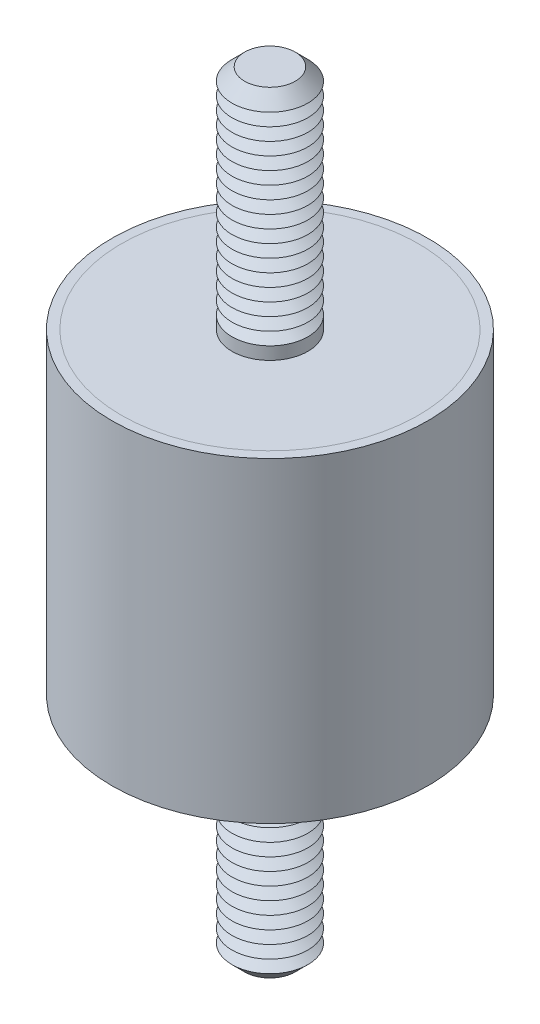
ISO-10303-21;
HEADER;
FILE_DESCRIPTION(('STEP AP214'),'2;1');
FILE_NAME('part.step','',(''),(''),'','','');
FILE_SCHEMA(('AUTOMOTIVE_DESIGN { 1 0 10303 214 1 1 1 1 }'));
ENDSEC;
DATA;
#1=APPLICATION_CONTEXT('core data for automotive mechanical design processes');
#2=APPLICATION_PROTOCOL_DEFINITION('international standard','automotive_design',2000,#1);
#3=PRODUCT_CONTEXT('',#1,'mechanical');
#4=PRODUCT('Part','Part','',(#3));
#5=PRODUCT_RELATED_PRODUCT_CATEGORY('part','',(#4));
#6=PRODUCT_DEFINITION_FORMATION('','',#4);
#7=PRODUCT_DEFINITION_CONTEXT('part definition',#1,'design');
#8=PRODUCT_DEFINITION('design','',#6,#7);
#9=PRODUCT_DEFINITION_SHAPE('','',#8);
#10=(LENGTH_UNIT() NAMED_UNIT(*) SI_UNIT(.MILLI.,.METRE.));
#11=(NAMED_UNIT(*) PLANE_ANGLE_UNIT() SI_UNIT($,.RADIAN.));
#12=(NAMED_UNIT(*) SI_UNIT($,.STERADIAN.) SOLID_ANGLE_UNIT());
#13=UNCERTAINTY_MEASURE_WITH_UNIT(LENGTH_MEASURE(1.E-05),#10,'distance_accuracy_value','');
#14=(GEOMETRIC_REPRESENTATION_CONTEXT(3) GLOBAL_UNCERTAINTY_ASSIGNED_CONTEXT((#13)) GLOBAL_UNIT_ASSIGNED_CONTEXT((#10,
#11,#12)) REPRESENTATION_CONTEXT('',''));
#15=CARTESIAN_POINT('',(0.,0.,0.));
#16=DIRECTION('',(0.,0.,1.));
#17=DIRECTION('',(1.,0.,0.));
#18=AXIS2_PLACEMENT_3D('',#15,#16,#17);
#19=CARTESIAN_POINT('',(0.,-30.5,0.));
#20=DIRECTION('',(0.,1.,0.));
#21=DIRECTION('',(0.,0.,1.));
#22=AXIS2_PLACEMENT_3D('',#19,#20,#21);
#23=CYLINDRICAL_SURFACE('',#22,3.);
#24=CARTESIAN_POINT('',(0.,-12.5,0.));
#25=DIRECTION('',(0.,-1.,0.));
#26=DIRECTION('',(0.,0.,-1.));
#27=AXIS2_PLACEMENT_3D('',#24,#25,#26);
#28=CIRCLE('',#27,3.);
#29=CARTESIAN_POINT('',(0.,-12.5,-3.));
#30=VERTEX_POINT('',#29);
#31=EDGE_CURVE('P0_E21',#30,#30,#28,.T.);
#32=ORIENTED_EDGE('',*,*,#31,.T.);
#33=EDGE_LOOP('',(#32));
#34=FACE_BOUND('',#33,.T.);
#35=CARTESIAN_POINT('',(0.,-13.5,0.));
#36=DIRECTION('',(0.,1.,0.));
#37=DIRECTION('',(0.,0.,1.));
#38=AXIS2_PLACEMENT_3D('',#35,#36,#37);
#39=CIRCLE('',#38,3.);
#40=CARTESIAN_POINT('',(0.,-13.5,3.));
#41=VERTEX_POINT('',#40);
#42=EDGE_CURVE('P0_E33',#41,#41,#39,.T.);
#43=ORIENTED_EDGE('',*,*,#42,.T.);
#44=EDGE_LOOP('',(#43));
#45=FACE_BOUND('',#44,.T.);
#46=ADVANCED_FACE('P0_F14',(#34,#45),#23,.T.);
#47=CARTESIAN_POINT('',(0.,-12.5,0.));
#48=DIRECTION('',(0.,1.,0.));
#49=DIRECTION('',(0.,0.,1.));
#50=AXIS2_PLACEMENT_3D('',#47,#48,#49);
#51=CYLINDRICAL_SURFACE('',#50,11.75);
#52=CARTESIAN_POINT('',(0.,-12.5,0.));
#53=DIRECTION('',(0.,1.,0.));
#54=DIRECTION('',(0.,0.,1.));
#55=AXIS2_PLACEMENT_3D('',#52,#53,#54);
#56=CIRCLE('',#55,11.75);
#57=CARTESIAN_POINT('',(0.,-12.5,11.75));
#58=VERTEX_POINT('',#57);
#59=EDGE_CURVE('P0_E25',#58,#58,#56,.T.);
#60=ORIENTED_EDGE('',*,*,#59,.T.);
#61=EDGE_LOOP('',(#60));
#62=FACE_BOUND('',#61,.T.);
#63=CARTESIAN_POINT('',(0.,-11.5,0.));
#64=DIRECTION('',(0.,1.,0.));
#65=DIRECTION('',(0.,0.,1.));
#66=AXIS2_PLACEMENT_3D('',#63,#64,#65);
#67=CIRCLE('',#66,11.75);
#68=CARTESIAN_POINT('',(0.,-11.5,11.75));
#69=VERTEX_POINT('',#68);
#70=EDGE_CURVE('P0_E30',#69,#69,#67,.T.);
#71=ORIENTED_EDGE('',*,*,#70,.F.);
#72=EDGE_LOOP('',(#71));
#73=FACE_BOUND('',#72,.T.);
#74=ADVANCED_FACE('P0_F157',(#62,#73),#51,.T.);
#75=CARTESIAN_POINT('',(0.,-12.5,0.));
#76=DIRECTION('',(0.,1.,0.));
#77=DIRECTION('',(0.,0.,1.));
#78=AXIS2_PLACEMENT_3D('',#75,#76,#77);
#79=PLANE('',#78);
#80=ORIENTED_EDGE('',*,*,#31,.F.);
#81=EDGE_LOOP('',(#80));
#82=FACE_BOUND('',#81,.T.);
#83=ORIENTED_EDGE('',*,*,#59,.F.);
#84=EDGE_LOOP('',(#83));
#85=FACE_BOUND('',#84,.T.);
#86=ADVANCED_FACE('P0_F162',(#82,#85),#79,.F.);
#87=CARTESIAN_POINT('',(0.,-11.5,0.));
#88=DIRECTION('',(0.,1.,0.));
#89=DIRECTION('',(0.,0.,1.));
#90=AXIS2_PLACEMENT_3D('',#87,#88,#89);
#91=PLANE('',#90);
#92=ORIENTED_EDGE('',*,*,#70,.T.);
#93=EDGE_LOOP('',(#92));
#94=FACE_BOUND('',#93,.T.);
#95=ADVANCED_FACE('P0_F168',(#94),#91,.T.);
#96=CARTESIAN_POINT('',(0.,-13.5,0.));
#97=DIRECTION('',(0.,1.,0.));
#98=DIRECTION('',(0.,0.,1.));
#99=AXIS2_PLACEMENT_3D('',#96,#97,#98);
#100=CONICAL_SURFACE('',#99,3.,1.0471975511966);
#101=CARTESIAN_POINT('',(0.,-14.,0.));
#102=DIRECTION('',(0.,1.,0.));
#103=DIRECTION('',(0.,0.,1.));
#104=AXIS2_PLACEMENT_3D('',#101,#102,#103);
#105=CIRCLE('',#104,2.13397459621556);
#106=CARTESIAN_POINT('',(0.,-14.,2.13397459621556));
#107=VERTEX_POINT('',#106);
#108=EDGE_CURVE('P0_E39',#107,#107,#105,.T.);
#109=ORIENTED_EDGE('',*,*,#108,.T.);
#110=EDGE_LOOP('',(#109));
#111=FACE_BOUND('',#110,.T.);
#112=ORIENTED_EDGE('',*,*,#42,.F.);
#113=EDGE_LOOP('',(#112));
#114=FACE_BOUND('',#113,.T.);
#115=ADVANCED_FACE('P0_F171',(#111,#114),#100,.T.);
#116=CARTESIAN_POINT('',(0.,-14.,0.));
#117=DIRECTION('',(0.,-1.,0.));
#118=DIRECTION('',(0.,0.,-1.));
#119=AXIS2_PLACEMENT_3D('',#116,#117,#118);
#120=CONICAL_SURFACE('',#119,2.13397459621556,1.0471975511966);
#121=CARTESIAN_POINT('',(0.,-14.5,0.));
#122=DIRECTION('',(0.,1.,0.));
#123=DIRECTION('',(0.,0.,1.));
#124=AXIS2_PLACEMENT_3D('',#121,#122,#123);
#125=CIRCLE('',#124,3.);
#126=CARTESIAN_POINT('',(0.,-14.5,3.));
#127=VERTEX_POINT('',#126);
#128=EDGE_CURVE('P0_E43',#127,#127,#125,.T.);
#129=ORIENTED_EDGE('',*,*,#128,.T.);
#130=EDGE_LOOP('',(#129));
#131=FACE_BOUND('',#130,.T.);
#132=ORIENTED_EDGE('',*,*,#108,.F.);
#133=EDGE_LOOP('',(#132));
#134=FACE_BOUND('',#133,.T.);
#135=ADVANCED_FACE('P0_F175',(#131,#134),#120,.T.);
#136=CARTESIAN_POINT('',(0.,-14.5,0.));
#137=DIRECTION('',(0.,1.,0.));
#138=DIRECTION('',(0.,0.,1.));
#139=AXIS2_PLACEMENT_3D('',#136,#137,#138);
#140=CONICAL_SURFACE('',#139,3.,1.0471975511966);
#141=CARTESIAN_POINT('',(0.,-15.,0.));
#142=DIRECTION('',(0.,1.,0.));
#143=DIRECTION('',(0.,0.,1.));
#144=AXIS2_PLACEMENT_3D('',#141,#142,#143);
#145=CIRCLE('',#144,2.13397459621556);
#146=CARTESIAN_POINT('',(0.,-15.,2.13397459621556));
#147=VERTEX_POINT('',#146);
#148=EDGE_CURVE('P0_E47',#147,#147,#145,.T.);
#149=ORIENTED_EDGE('',*,*,#148,.T.);
#150=EDGE_LOOP('',(#149));
#151=FACE_BOUND('',#150,.T.);
#152=ORIENTED_EDGE('',*,*,#128,.F.);
#153=EDGE_LOOP('',(#152));
#154=FACE_BOUND('',#153,.T.);
#155=ADVANCED_FACE('P0_F179',(#151,#154),#140,.T.);
#156=CARTESIAN_POINT('',(0.,-15.,0.));
#157=DIRECTION('',(0.,-1.,0.));
#158=DIRECTION('',(0.,0.,-1.));
#159=AXIS2_PLACEMENT_3D('',#156,#157,#158);
#160=CONICAL_SURFACE('',#159,2.13397459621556,1.0471975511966);
#161=CARTESIAN_POINT('',(0.,-15.5,0.));
#162=DIRECTION('',(0.,1.,0.));
#163=DIRECTION('',(0.,0.,1.));
#164=AXIS2_PLACEMENT_3D('',#161,#162,#163);
#165=CIRCLE('',#164,3.);
#166=CARTESIAN_POINT('',(0.,-15.5,3.));
#167=VERTEX_POINT('',#166);
#168=EDGE_CURVE('P0_E52',#167,#167,#165,.T.);
#169=ORIENTED_EDGE('',*,*,#168,.T.);
#170=EDGE_LOOP('',(#169));
#171=FACE_BOUND('',#170,.T.);
#172=ORIENTED_EDGE('',*,*,#148,.F.);
#173=EDGE_LOOP('',(#172));
#174=FACE_BOUND('',#173,.T.);
#175=ADVANCED_FACE('P0_F186',(#171,#174),#160,.T.);
#176=CARTESIAN_POINT('',(0.,-15.5,0.));
#177=DIRECTION('',(0.,1.,0.));
#178=DIRECTION('',(0.,0.,1.));
#179=AXIS2_PLACEMENT_3D('',#176,#177,#178);
#180=CONICAL_SURFACE('',#179,3.,1.0471975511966);
#181=CARTESIAN_POINT('',(0.,-16.,0.));
#182=DIRECTION('',(0.,1.,0.));
#183=DIRECTION('',(0.,0.,1.));
#184=AXIS2_PLACEMENT_3D('',#181,#182,#183);
#185=CIRCLE('',#184,2.13397459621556);
#186=CARTESIAN_POINT('',(0.,-16.,2.13397459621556));
#187=VERTEX_POINT('',#186);
#188=EDGE_CURVE('P0_E55',#187,#187,#185,.T.);
#189=ORIENTED_EDGE('',*,*,#188,.T.);
#190=EDGE_LOOP('',(#189));
#191=FACE_BOUND('',#190,.T.);
#192=ORIENTED_EDGE('',*,*,#168,.F.);
#193=EDGE_LOOP('',(#192));
#194=FACE_BOUND('',#193,.T.);
#195=ADVANCED_FACE('P0_F190',(#191,#194),#180,.T.);
#196=CARTESIAN_POINT('',(0.,-16.,0.));
#197=DIRECTION('',(0.,-1.,0.));
#198=DIRECTION('',(0.,0.,-1.));
#199=AXIS2_PLACEMENT_3D('',#196,#197,#198);
#200=CONICAL_SURFACE('',#199,2.13397459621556,1.0471975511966);
#201=CARTESIAN_POINT('',(0.,-16.5,0.));
#202=DIRECTION('',(0.,1.,0.));
#203=DIRECTION('',(0.,0.,1.));
#204=AXIS2_PLACEMENT_3D('',#201,#202,#203);
#205=CIRCLE('',#204,3.);
#206=CARTESIAN_POINT('',(0.,-16.5,3.));
#207=VERTEX_POINT('',#206);
#208=EDGE_CURVE('P0_E58',#207,#207,#205,.T.);
#209=ORIENTED_EDGE('',*,*,#208,.T.);
#210=EDGE_LOOP('',(#209));
#211=FACE_BOUND('',#210,.T.);
#212=ORIENTED_EDGE('',*,*,#188,.F.);
#213=EDGE_LOOP('',(#212));
#214=FACE_BOUND('',#213,.T.);
#215=ADVANCED_FACE('P0_F194',(#211,#214),#200,.T.);
#216=CARTESIAN_POINT('',(0.,-16.5,0.));
#217=DIRECTION('',(0.,1.,0.));
#218=DIRECTION('',(0.,0.,1.));
#219=AXIS2_PLACEMENT_3D('',#216,#217,#218);
#220=CONICAL_SURFACE('',#219,3.,1.0471975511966);
#221=CARTESIAN_POINT('',(0.,-17.,0.));
#222=DIRECTION('',(0.,1.,0.));
#223=DIRECTION('',(0.,0.,1.));
#224=AXIS2_PLACEMENT_3D('',#221,#222,#223);
#225=CIRCLE('',#224,2.13397459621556);
#226=CARTESIAN_POINT('',(0.,-17.,2.13397459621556));
#227=VERTEX_POINT('',#226);
#228=EDGE_CURVE('P0_E61',#227,#227,#225,.T.);
#229=ORIENTED_EDGE('',*,*,#228,.T.);
#230=EDGE_LOOP('',(#229));
#231=FACE_BOUND('',#230,.T.);
#232=ORIENTED_EDGE('',*,*,#208,.F.);
#233=EDGE_LOOP('',(#232));
#234=FACE_BOUND('',#233,.T.);
#235=ADVANCED_FACE('P0_F198',(#231,#234),#220,.T.);
#236=CARTESIAN_POINT('',(0.,-17.,0.));
#237=DIRECTION('',(0.,-1.,0.));
#238=DIRECTION('',(0.,0.,-1.));
#239=AXIS2_PLACEMENT_3D('',#236,#237,#238);
#240=CONICAL_SURFACE('',#239,2.13397459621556,1.0471975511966);
#241=CARTESIAN_POINT('',(0.,-17.5,0.));
#242=DIRECTION('',(0.,1.,0.));
#243=DIRECTION('',(0.,0.,1.));
#244=AXIS2_PLACEMENT_3D('',#241,#242,#243);
#245=CIRCLE('',#244,3.);
#246=CARTESIAN_POINT('',(0.,-17.5,3.));
#247=VERTEX_POINT('',#246);
#248=EDGE_CURVE('P0_E64',#247,#247,#245,.T.);
#249=ORIENTED_EDGE('',*,*,#248,.T.);
#250=EDGE_LOOP('',(#249));
#251=FACE_BOUND('',#250,.T.);
#252=ORIENTED_EDGE('',*,*,#228,.F.);
#253=EDGE_LOOP('',(#252));
#254=FACE_BOUND('',#253,.T.);
#255=ADVANCED_FACE('P0_F202',(#251,#254),#240,.T.);
#256=CARTESIAN_POINT('',(0.,-17.5,0.));
#257=DIRECTION('',(0.,1.,0.));
#258=DIRECTION('',(0.,0.,1.));
#259=AXIS2_PLACEMENT_3D('',#256,#257,#258);
#260=CONICAL_SURFACE('',#259,3.,1.0471975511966);
#261=CARTESIAN_POINT('',(0.,-18.,0.));
#262=DIRECTION('',(0.,1.,0.));
#263=DIRECTION('',(0.,0.,1.));
#264=AXIS2_PLACEMENT_3D('',#261,#262,#263);
#265=CIRCLE('',#264,2.13397459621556);
#266=CARTESIAN_POINT('',(0.,-18.,2.13397459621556));
#267=VERTEX_POINT('',#266);
#268=EDGE_CURVE('P0_E67',#267,#267,#265,.T.);
#269=ORIENTED_EDGE('',*,*,#268,.T.);
#270=EDGE_LOOP('',(#269));
#271=FACE_BOUND('',#270,.T.);
#272=ORIENTED_EDGE('',*,*,#248,.F.);
#273=EDGE_LOOP('',(#272));
#274=FACE_BOUND('',#273,.T.);
#275=ADVANCED_FACE('P0_F206',(#271,#274),#260,.T.);
#276=CARTESIAN_POINT('',(0.,-18.,0.));
#277=DIRECTION('',(0.,-1.,0.));
#278=DIRECTION('',(0.,0.,-1.));
#279=AXIS2_PLACEMENT_3D('',#276,#277,#278);
#280=CONICAL_SURFACE('',#279,2.13397459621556,1.0471975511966);
#281=CARTESIAN_POINT('',(0.,-18.5,0.));
#282=DIRECTION('',(0.,1.,0.));
#283=DIRECTION('',(0.,0.,1.));
#284=AXIS2_PLACEMENT_3D('',#281,#282,#283);
#285=CIRCLE('',#284,3.);
#286=CARTESIAN_POINT('',(0.,-18.5,3.));
#287=VERTEX_POINT('',#286);
#288=EDGE_CURVE('P0_E70',#287,#287,#285,.T.);
#289=ORIENTED_EDGE('',*,*,#288,.T.);
#290=EDGE_LOOP('',(#289));
#291=FACE_BOUND('',#290,.T.);
#292=ORIENTED_EDGE('',*,*,#268,.F.);
#293=EDGE_LOOP('',(#292));
#294=FACE_BOUND('',#293,.T.);
#295=ADVANCED_FACE('P0_F210',(#291,#294),#280,.T.);
#296=CARTESIAN_POINT('',(0.,-18.5,0.));
#297=DIRECTION('',(0.,1.,0.));
#298=DIRECTION('',(0.,0.,1.));
#299=AXIS2_PLACEMENT_3D('',#296,#297,#298);
#300=CONICAL_SURFACE('',#299,3.,1.0471975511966);
#301=CARTESIAN_POINT('',(0.,-19.,0.));
#302=DIRECTION('',(0.,1.,0.));
#303=DIRECTION('',(0.,0.,1.));
#304=AXIS2_PLACEMENT_3D('',#301,#302,#303);
#305=CIRCLE('',#304,2.13397459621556);
#306=CARTESIAN_POINT('',(0.,-19.,2.13397459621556));
#307=VERTEX_POINT('',#306);
#308=EDGE_CURVE('P0_E73',#307,#307,#305,.T.);
#309=ORIENTED_EDGE('',*,*,#308,.T.);
#310=EDGE_LOOP('',(#309));
#311=FACE_BOUND('',#310,.T.);
#312=ORIENTED_EDGE('',*,*,#288,.F.);
#313=EDGE_LOOP('',(#312));
#314=FACE_BOUND('',#313,.T.);
#315=ADVANCED_FACE('P0_F214',(#311,#314),#300,.T.);
#316=CARTESIAN_POINT('',(0.,-19.,0.));
#317=DIRECTION('',(0.,-1.,0.));
#318=DIRECTION('',(0.,0.,-1.));
#319=AXIS2_PLACEMENT_3D('',#316,#317,#318);
#320=CONICAL_SURFACE('',#319,2.13397459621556,1.0471975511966);
#321=CARTESIAN_POINT('',(0.,-19.5,0.));
#322=DIRECTION('',(0.,1.,0.));
#323=DIRECTION('',(0.,0.,1.));
#324=AXIS2_PLACEMENT_3D('',#321,#322,#323);
#325=CIRCLE('',#324,3.);
#326=CARTESIAN_POINT('',(0.,-19.5,3.));
#327=VERTEX_POINT('',#326);
#328=EDGE_CURVE('P0_E76',#327,#327,#325,.T.);
#329=ORIENTED_EDGE('',*,*,#328,.T.);
#330=EDGE_LOOP('',(#329));
#331=FACE_BOUND('',#330,.T.);
#332=ORIENTED_EDGE('',*,*,#308,.F.);
#333=EDGE_LOOP('',(#332));
#334=FACE_BOUND('',#333,.T.);
#335=ADVANCED_FACE('P0_F218',(#331,#334),#320,.T.);
#336=CARTESIAN_POINT('',(0.,-19.5,0.));
#337=DIRECTION('',(0.,1.,0.));
#338=DIRECTION('',(0.,0.,1.));
#339=AXIS2_PLACEMENT_3D('',#336,#337,#338);
#340=CONICAL_SURFACE('',#339,3.,1.0471975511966);
#341=CARTESIAN_POINT('',(0.,-20.,0.));
#342=DIRECTION('',(0.,1.,0.));
#343=DIRECTION('',(0.,0.,1.));
#344=AXIS2_PLACEMENT_3D('',#341,#342,#343);
#345=CIRCLE('',#344,2.13397459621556);
#346=CARTESIAN_POINT('',(0.,-20.,2.13397459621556));
#347=VERTEX_POINT('',#346);
#348=EDGE_CURVE('P0_E79',#347,#347,#345,.T.);
#349=ORIENTED_EDGE('',*,*,#348,.T.);
#350=EDGE_LOOP('',(#349));
#351=FACE_BOUND('',#350,.T.);
#352=ORIENTED_EDGE('',*,*,#328,.F.);
#353=EDGE_LOOP('',(#352));
#354=FACE_BOUND('',#353,.T.);
#355=ADVANCED_FACE('P0_F222',(#351,#354),#340,.T.);
#356=CARTESIAN_POINT('',(0.,-20.,0.));
#357=DIRECTION('',(0.,-1.,0.));
#358=DIRECTION('',(0.,0.,-1.));
#359=AXIS2_PLACEMENT_3D('',#356,#357,#358);
#360=CONICAL_SURFACE('',#359,2.13397459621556,1.0471975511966);
#361=CARTESIAN_POINT('',(0.,-20.5,0.));
#362=DIRECTION('',(0.,1.,0.));
#363=DIRECTION('',(0.,0.,1.));
#364=AXIS2_PLACEMENT_3D('',#361,#362,#363);
#365=CIRCLE('',#364,3.);
#366=CARTESIAN_POINT('',(0.,-20.5,3.));
#367=VERTEX_POINT('',#366);
#368=EDGE_CURVE('P0_E82',#367,#367,#365,.T.);
#369=ORIENTED_EDGE('',*,*,#368,.T.);
#370=EDGE_LOOP('',(#369));
#371=FACE_BOUND('',#370,.T.);
#372=ORIENTED_EDGE('',*,*,#348,.F.);
#373=EDGE_LOOP('',(#372));
#374=FACE_BOUND('',#373,.T.);
#375=ADVANCED_FACE('P0_F226',(#371,#374),#360,.T.);
#376=CARTESIAN_POINT('',(0.,-20.5,0.));
#377=DIRECTION('',(0.,1.,0.));
#378=DIRECTION('',(0.,0.,1.));
#379=AXIS2_PLACEMENT_3D('',#376,#377,#378);
#380=CONICAL_SURFACE('',#379,3.,1.0471975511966);
#381=CARTESIAN_POINT('',(0.,-21.,0.));
#382=DIRECTION('',(0.,1.,0.));
#383=DIRECTION('',(0.,0.,1.));
#384=AXIS2_PLACEMENT_3D('',#381,#382,#383);
#385=CIRCLE('',#384,2.13397459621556);
#386=CARTESIAN_POINT('',(0.,-21.,2.13397459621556));
#387=VERTEX_POINT('',#386);
#388=EDGE_CURVE('P0_E85',#387,#387,#385,.T.);
#389=ORIENTED_EDGE('',*,*,#388,.T.);
#390=EDGE_LOOP('',(#389));
#391=FACE_BOUND('',#390,.T.);
#392=ORIENTED_EDGE('',*,*,#368,.F.);
#393=EDGE_LOOP('',(#392));
#394=FACE_BOUND('',#393,.T.);
#395=ADVANCED_FACE('P0_F230',(#391,#394),#380,.T.);
#396=CARTESIAN_POINT('',(0.,-21.,0.));
#397=DIRECTION('',(0.,-1.,0.));
#398=DIRECTION('',(0.,0.,-1.));
#399=AXIS2_PLACEMENT_3D('',#396,#397,#398);
#400=CONICAL_SURFACE('',#399,2.13397459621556,1.0471975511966);
#401=CARTESIAN_POINT('',(0.,-21.5,0.));
#402=DIRECTION('',(0.,1.,0.));
#403=DIRECTION('',(0.,0.,1.));
#404=AXIS2_PLACEMENT_3D('',#401,#402,#403);
#405=CIRCLE('',#404,3.);
#406=CARTESIAN_POINT('',(0.,-21.5,3.));
#407=VERTEX_POINT('',#406);
#408=EDGE_CURVE('P0_E88',#407,#407,#405,.T.);
#409=ORIENTED_EDGE('',*,*,#408,.T.);
#410=EDGE_LOOP('',(#409));
#411=FACE_BOUND('',#410,.T.);
#412=ORIENTED_EDGE('',*,*,#388,.F.);
#413=EDGE_LOOP('',(#412));
#414=FACE_BOUND('',#413,.T.);
#415=ADVANCED_FACE('P0_F234',(#411,#414),#400,.T.);
#416=CARTESIAN_POINT('',(0.,-21.5,0.));
#417=DIRECTION('',(0.,1.,0.));
#418=DIRECTION('',(0.,0.,1.));
#419=AXIS2_PLACEMENT_3D('',#416,#417,#418);
#420=CONICAL_SURFACE('',#419,3.,1.0471975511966);
#421=CARTESIAN_POINT('',(0.,-22.,0.));
#422=DIRECTION('',(0.,1.,0.));
#423=DIRECTION('',(0.,0.,1.));
#424=AXIS2_PLACEMENT_3D('',#421,#422,#423);
#425=CIRCLE('',#424,2.13397459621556);
#426=CARTESIAN_POINT('',(0.,-22.,2.13397459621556));
#427=VERTEX_POINT('',#426);
#428=EDGE_CURVE('P0_E91',#427,#427,#425,.T.);
#429=ORIENTED_EDGE('',*,*,#428,.T.);
#430=EDGE_LOOP('',(#429));
#431=FACE_BOUND('',#430,.T.);
#432=ORIENTED_EDGE('',*,*,#408,.F.);
#433=EDGE_LOOP('',(#432));
#434=FACE_BOUND('',#433,.T.);
#435=ADVANCED_FACE('P0_F238',(#431,#434),#420,.T.);
#436=CARTESIAN_POINT('',(0.,-22.,0.));
#437=DIRECTION('',(0.,-1.,0.));
#438=DIRECTION('',(0.,0.,-1.));
#439=AXIS2_PLACEMENT_3D('',#436,#437,#438);
#440=CONICAL_SURFACE('',#439,2.13397459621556,1.0471975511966);
#441=CARTESIAN_POINT('',(0.,-22.5,0.));
#442=DIRECTION('',(0.,1.,0.));
#443=DIRECTION('',(0.,0.,1.));
#444=AXIS2_PLACEMENT_3D('',#441,#442,#443);
#445=CIRCLE('',#444,3.);
#446=CARTESIAN_POINT('',(0.,-22.5,3.));
#447=VERTEX_POINT('',#446);
#448=EDGE_CURVE('P0_E94',#447,#447,#445,.T.);
#449=ORIENTED_EDGE('',*,*,#448,.T.);
#450=EDGE_LOOP('',(#449));
#451=FACE_BOUND('',#450,.T.);
#452=ORIENTED_EDGE('',*,*,#428,.F.);
#453=EDGE_LOOP('',(#452));
#454=FACE_BOUND('',#453,.T.);
#455=ADVANCED_FACE('P0_F242',(#451,#454),#440,.T.);
#456=CARTESIAN_POINT('',(0.,-22.5,0.));
#457=DIRECTION('',(0.,1.,0.));
#458=DIRECTION('',(0.,0.,1.));
#459=AXIS2_PLACEMENT_3D('',#456,#457,#458);
#460=CONICAL_SURFACE('',#459,3.,1.0471975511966);
#461=CARTESIAN_POINT('',(0.,-23.,0.));
#462=DIRECTION('',(0.,1.,0.));
#463=DIRECTION('',(0.,0.,1.));
#464=AXIS2_PLACEMENT_3D('',#461,#462,#463);
#465=CIRCLE('',#464,2.13397459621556);
#466=CARTESIAN_POINT('',(0.,-23.,2.13397459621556));
#467=VERTEX_POINT('',#466);
#468=EDGE_CURVE('P0_E97',#467,#467,#465,.T.);
#469=ORIENTED_EDGE('',*,*,#468,.T.);
#470=EDGE_LOOP('',(#469));
#471=FACE_BOUND('',#470,.T.);
#472=ORIENTED_EDGE('',*,*,#448,.F.);
#473=EDGE_LOOP('',(#472));
#474=FACE_BOUND('',#473,.T.);
#475=ADVANCED_FACE('P0_F246',(#471,#474),#460,.T.);
#476=CARTESIAN_POINT('',(0.,-23.,0.));
#477=DIRECTION('',(0.,-1.,0.));
#478=DIRECTION('',(0.,0.,-1.));
#479=AXIS2_PLACEMENT_3D('',#476,#477,#478);
#480=CONICAL_SURFACE('',#479,2.13397459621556,1.0471975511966);
#481=CARTESIAN_POINT('',(0.,-23.5,0.));
#482=DIRECTION('',(0.,1.,0.));
#483=DIRECTION('',(0.,0.,1.));
#484=AXIS2_PLACEMENT_3D('',#481,#482,#483);
#485=CIRCLE('',#484,3.);
#486=CARTESIAN_POINT('',(0.,-23.5,3.));
#487=VERTEX_POINT('',#486);
#488=EDGE_CURVE('P0_E100',#487,#487,#485,.T.);
#489=ORIENTED_EDGE('',*,*,#488,.T.);
#490=EDGE_LOOP('',(#489));
#491=FACE_BOUND('',#490,.T.);
#492=ORIENTED_EDGE('',*,*,#468,.F.);
#493=EDGE_LOOP('',(#492));
#494=FACE_BOUND('',#493,.T.);
#495=ADVANCED_FACE('P0_F250',(#491,#494),#480,.T.);
#496=CARTESIAN_POINT('',(0.,-23.5,0.));
#497=DIRECTION('',(0.,1.,0.));
#498=DIRECTION('',(0.,0.,1.));
#499=AXIS2_PLACEMENT_3D('',#496,#497,#498);
#500=CONICAL_SURFACE('',#499,3.,1.0471975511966);
#501=CARTESIAN_POINT('',(0.,-24.,0.));
#502=DIRECTION('',(0.,1.,0.));
#503=DIRECTION('',(0.,0.,1.));
#504=AXIS2_PLACEMENT_3D('',#501,#502,#503);
#505=CIRCLE('',#504,2.13397459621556);
#506=CARTESIAN_POINT('',(0.,-24.,2.13397459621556));
#507=VERTEX_POINT('',#506);
#508=EDGE_CURVE('P0_E103',#507,#507,#505,.T.);
#509=ORIENTED_EDGE('',*,*,#508,.T.);
#510=EDGE_LOOP('',(#509));
#511=FACE_BOUND('',#510,.T.);
#512=ORIENTED_EDGE('',*,*,#488,.F.);
#513=EDGE_LOOP('',(#512));
#514=FACE_BOUND('',#513,.T.);
#515=ADVANCED_FACE('P0_F254',(#511,#514),#500,.T.);
#516=CARTESIAN_POINT('',(0.,-24.,0.));
#517=DIRECTION('',(0.,-1.,0.));
#518=DIRECTION('',(0.,0.,-1.));
#519=AXIS2_PLACEMENT_3D('',#516,#517,#518);
#520=CONICAL_SURFACE('',#519,2.13397459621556,1.0471975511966);
#521=CARTESIAN_POINT('',(0.,-24.5,0.));
#522=DIRECTION('',(0.,1.,0.));
#523=DIRECTION('',(0.,0.,1.));
#524=AXIS2_PLACEMENT_3D('',#521,#522,#523);
#525=CIRCLE('',#524,3.);
#526=CARTESIAN_POINT('',(0.,-24.5,3.));
#527=VERTEX_POINT('',#526);
#528=EDGE_CURVE('P0_E106',#527,#527,#525,.T.);
#529=ORIENTED_EDGE('',*,*,#528,.T.);
#530=EDGE_LOOP('',(#529));
#531=FACE_BOUND('',#530,.T.);
#532=ORIENTED_EDGE('',*,*,#508,.F.);
#533=EDGE_LOOP('',(#532));
#534=FACE_BOUND('',#533,.T.);
#535=ADVANCED_FACE('P0_F258',(#531,#534),#520,.T.);
#536=CARTESIAN_POINT('',(0.,-24.5,0.));
#537=DIRECTION('',(0.,1.,0.));
#538=DIRECTION('',(0.,0.,1.));
#539=AXIS2_PLACEMENT_3D('',#536,#537,#538);
#540=CONICAL_SURFACE('',#539,3.,1.0471975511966);
#541=CARTESIAN_POINT('',(0.,-25.,0.));
#542=DIRECTION('',(0.,1.,0.));
#543=DIRECTION('',(0.,0.,1.));
#544=AXIS2_PLACEMENT_3D('',#541,#542,#543);
#545=CIRCLE('',#544,2.13397459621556);
#546=CARTESIAN_POINT('',(0.,-25.,2.13397459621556));
#547=VERTEX_POINT('',#546);
#548=EDGE_CURVE('P0_E109',#547,#547,#545,.T.);
#549=ORIENTED_EDGE('',*,*,#548,.T.);
#550=EDGE_LOOP('',(#549));
#551=FACE_BOUND('',#550,.T.);
#552=ORIENTED_EDGE('',*,*,#528,.F.);
#553=EDGE_LOOP('',(#552));
#554=FACE_BOUND('',#553,.T.);
#555=ADVANCED_FACE('P0_F262',(#551,#554),#540,.T.);
#556=CARTESIAN_POINT('',(0.,-25.,0.));
#557=DIRECTION('',(0.,-1.,0.));
#558=DIRECTION('',(0.,0.,-1.));
#559=AXIS2_PLACEMENT_3D('',#556,#557,#558);
#560=CONICAL_SURFACE('',#559,2.13397459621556,1.0471975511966);
#561=CARTESIAN_POINT('',(0.,-25.5,0.));
#562=DIRECTION('',(0.,1.,0.));
#563=DIRECTION('',(0.,0.,1.));
#564=AXIS2_PLACEMENT_3D('',#561,#562,#563);
#565=CIRCLE('',#564,3.);
#566=CARTESIAN_POINT('',(0.,-25.5,3.));
#567=VERTEX_POINT('',#566);
#568=EDGE_CURVE('P0_E112',#567,#567,#565,.T.);
#569=ORIENTED_EDGE('',*,*,#568,.T.);
#570=EDGE_LOOP('',(#569));
#571=FACE_BOUND('',#570,.T.);
#572=ORIENTED_EDGE('',*,*,#548,.F.);
#573=EDGE_LOOP('',(#572));
#574=FACE_BOUND('',#573,.T.);
#575=ADVANCED_FACE('P0_F266',(#571,#574),#560,.T.);
#576=CARTESIAN_POINT('',(0.,-25.5,0.));
#577=DIRECTION('',(0.,1.,0.));
#578=DIRECTION('',(0.,0.,1.));
#579=AXIS2_PLACEMENT_3D('',#576,#577,#578);
#580=CONICAL_SURFACE('',#579,3.,1.0471975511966);
#581=CARTESIAN_POINT('',(0.,-26.,0.));
#582=DIRECTION('',(0.,1.,0.));
#583=DIRECTION('',(0.,0.,1.));
#584=AXIS2_PLACEMENT_3D('',#581,#582,#583);
#585=CIRCLE('',#584,2.13397459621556);
#586=CARTESIAN_POINT('',(0.,-26.,2.13397459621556));
#587=VERTEX_POINT('',#586);
#588=EDGE_CURVE('P0_E115',#587,#587,#585,.T.);
#589=ORIENTED_EDGE('',*,*,#588,.T.);
#590=EDGE_LOOP('',(#589));
#591=FACE_BOUND('',#590,.T.);
#592=ORIENTED_EDGE('',*,*,#568,.F.);
#593=EDGE_LOOP('',(#592));
#594=FACE_BOUND('',#593,.T.);
#595=ADVANCED_FACE('P0_F270',(#591,#594),#580,.T.);
#596=CARTESIAN_POINT('',(0.,-26.,0.));
#597=DIRECTION('',(0.,-1.,0.));
#598=DIRECTION('',(0.,0.,-1.));
#599=AXIS2_PLACEMENT_3D('',#596,#597,#598);
#600=CONICAL_SURFACE('',#599,2.13397459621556,1.0471975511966);
#601=CARTESIAN_POINT('',(0.,-26.5,0.));
#602=DIRECTION('',(0.,1.,0.));
#603=DIRECTION('',(0.,0.,1.));
#604=AXIS2_PLACEMENT_3D('',#601,#602,#603);
#605=CIRCLE('',#604,3.);
#606=CARTESIAN_POINT('',(0.,-26.5,3.));
#607=VERTEX_POINT('',#606);
#608=EDGE_CURVE('P0_E118',#607,#607,#605,.T.);
#609=ORIENTED_EDGE('',*,*,#608,.T.);
#610=EDGE_LOOP('',(#609));
#611=FACE_BOUND('',#610,.T.);
#612=ORIENTED_EDGE('',*,*,#588,.F.);
#613=EDGE_LOOP('',(#612));
#614=FACE_BOUND('',#613,.T.);
#615=ADVANCED_FACE('P0_F274',(#611,#614),#600,.T.);
#616=CARTESIAN_POINT('',(0.,-26.5,0.));
#617=DIRECTION('',(0.,1.,0.));
#618=DIRECTION('',(0.,0.,1.));
#619=AXIS2_PLACEMENT_3D('',#616,#617,#618);
#620=CONICAL_SURFACE('',#619,3.,1.0471975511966);
#621=CARTESIAN_POINT('',(0.,-27.,0.));
#622=DIRECTION('',(0.,1.,0.));
#623=DIRECTION('',(0.,0.,1.));
#624=AXIS2_PLACEMENT_3D('',#621,#622,#623);
#625=CIRCLE('',#624,2.13397459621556);
#626=CARTESIAN_POINT('',(0.,-27.,2.13397459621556));
#627=VERTEX_POINT('',#626);
#628=EDGE_CURVE('P0_E121',#627,#627,#625,.T.);
#629=ORIENTED_EDGE('',*,*,#628,.T.);
#630=EDGE_LOOP('',(#629));
#631=FACE_BOUND('',#630,.T.);
#632=ORIENTED_EDGE('',*,*,#608,.F.);
#633=EDGE_LOOP('',(#632));
#634=FACE_BOUND('',#633,.T.);
#635=ADVANCED_FACE('P0_F278',(#631,#634),#620,.T.);
#636=CARTESIAN_POINT('',(0.,-27.,0.));
#637=DIRECTION('',(0.,-1.,0.));
#638=DIRECTION('',(0.,0.,-1.));
#639=AXIS2_PLACEMENT_3D('',#636,#637,#638);
#640=CONICAL_SURFACE('',#639,2.13397459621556,1.0471975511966);
#641=CARTESIAN_POINT('',(0.,-27.5,0.));
#642=DIRECTION('',(0.,1.,0.));
#643=DIRECTION('',(0.,0.,1.));
#644=AXIS2_PLACEMENT_3D('',#641,#642,#643);
#645=CIRCLE('',#644,3.);
#646=CARTESIAN_POINT('',(0.,-27.5,3.));
#647=VERTEX_POINT('',#646);
#648=EDGE_CURVE('P0_E124',#647,#647,#645,.T.);
#649=ORIENTED_EDGE('',*,*,#648,.T.);
#650=EDGE_LOOP('',(#649));
#651=FACE_BOUND('',#650,.T.);
#652=ORIENTED_EDGE('',*,*,#628,.F.);
#653=EDGE_LOOP('',(#652));
#654=FACE_BOUND('',#653,.T.);
#655=ADVANCED_FACE('P0_F282',(#651,#654),#640,.T.);
#656=CARTESIAN_POINT('',(0.,-27.5,0.));
#657=DIRECTION('',(0.,1.,0.));
#658=DIRECTION('',(0.,0.,1.));
#659=AXIS2_PLACEMENT_3D('',#656,#657,#658);
#660=CONICAL_SURFACE('',#659,3.,1.0471975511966);
#661=CARTESIAN_POINT('',(0.,-28.,0.));
#662=DIRECTION('',(0.,1.,0.));
#663=DIRECTION('',(0.,0.,1.));
#664=AXIS2_PLACEMENT_3D('',#661,#662,#663);
#665=CIRCLE('',#664,2.13397459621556);
#666=CARTESIAN_POINT('',(0.,-28.,2.13397459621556));
#667=VERTEX_POINT('',#666);
#668=EDGE_CURVE('P0_E127',#667,#667,#665,.T.);
#669=ORIENTED_EDGE('',*,*,#668,.T.);
#670=EDGE_LOOP('',(#669));
#671=FACE_BOUND('',#670,.T.);
#672=ORIENTED_EDGE('',*,*,#648,.F.);
#673=EDGE_LOOP('',(#672));
#674=FACE_BOUND('',#673,.T.);
#675=ADVANCED_FACE('P0_F286',(#671,#674),#660,.T.);
#676=CARTESIAN_POINT('',(0.,-28.,0.));
#677=DIRECTION('',(0.,-1.,0.));
#678=DIRECTION('',(0.,0.,-1.));
#679=AXIS2_PLACEMENT_3D('',#676,#677,#678);
#680=CONICAL_SURFACE('',#679,2.13397459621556,1.0471975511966);
#681=CARTESIAN_POINT('',(0.,-28.5,0.));
#682=DIRECTION('',(0.,1.,0.));
#683=DIRECTION('',(0.,0.,1.));
#684=AXIS2_PLACEMENT_3D('',#681,#682,#683);
#685=CIRCLE('',#684,3.);
#686=CARTESIAN_POINT('',(0.,-28.5,3.));
#687=VERTEX_POINT('',#686);
#688=EDGE_CURVE('P0_E130',#687,#687,#685,.T.);
#689=ORIENTED_EDGE('',*,*,#688,.T.);
#690=EDGE_LOOP('',(#689));
#691=FACE_BOUND('',#690,.T.);
#692=ORIENTED_EDGE('',*,*,#668,.F.);
#693=EDGE_LOOP('',(#692));
#694=FACE_BOUND('',#693,.T.);
#695=ADVANCED_FACE('P0_F154',(#691,#694),#680,.T.);
#696=CARTESIAN_POINT('',(0.,-28.5,0.));
#697=DIRECTION('',(0.,1.,0.));
#698=DIRECTION('',(0.,0.,1.));
#699=AXIS2_PLACEMENT_3D('',#696,#697,#698);
#700=CONICAL_SURFACE('',#699,3.,1.0471975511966);
#701=CARTESIAN_POINT('',(0.,-29.,0.));
#702=DIRECTION('',(0.,1.,0.));
#703=DIRECTION('',(0.,0.,1.));
#704=AXIS2_PLACEMENT_3D('',#701,#702,#703);
#705=CIRCLE('',#704,2.13397459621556);
#706=CARTESIAN_POINT('',(0.,-29.,2.13397459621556));
#707=VERTEX_POINT('',#706);
#708=EDGE_CURVE('P0_E136',#707,#707,#705,.T.);
#709=ORIENTED_EDGE('',*,*,#708,.T.);
#710=EDGE_LOOP('',(#709));
#711=FACE_BOUND('',#710,.T.);
#712=ORIENTED_EDGE('',*,*,#688,.F.);
#713=EDGE_LOOP('',(#712));
#714=FACE_BOUND('',#713,.T.);
#715=ADVANCED_FACE('P0_F140',(#711,#714),#700,.T.);
#716=CARTESIAN_POINT('',(0.,-29.,0.));
#717=DIRECTION('',(0.,-1.,0.));
#718=DIRECTION('',(0.,0.,-1.));
#719=AXIS2_PLACEMENT_3D('',#716,#717,#718);
#720=CONICAL_SURFACE('',#719,2.13397459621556,1.0471975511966);
#721=CARTESIAN_POINT('',(0.,-29.5,0.));
#722=DIRECTION('',(0.,1.,0.));
#723=DIRECTION('',(0.,0.,1.));
#724=AXIS2_PLACEMENT_3D('',#721,#722,#723);
#725=CIRCLE('',#724,3.);
#726=CARTESIAN_POINT('',(0.,-29.5,3.));
#727=VERTEX_POINT('',#726);
#728=EDGE_CURVE('P0_E133',#727,#727,#725,.T.);
#729=ORIENTED_EDGE('',*,*,#728,.T.);
#730=EDGE_LOOP('',(#729));
#731=FACE_BOUND('',#730,.T.);
#732=ORIENTED_EDGE('',*,*,#708,.F.);
#733=EDGE_LOOP('',(#732));
#734=FACE_BOUND('',#733,.T.);
#735=ADVANCED_FACE('P0_F143',(#731,#734),#720,.T.);
#736=CARTESIAN_POINT('',(0.,-30.5,0.));
#737=DIRECTION('',(0.,-1.,0.));
#738=DIRECTION('',(0.,0.,-1.));
#739=AXIS2_PLACEMENT_3D('',#736,#737,#738);
#740=PLANE('',#739);
#741=CARTESIAN_POINT('',(0.,-30.5,0.));
#742=DIRECTION('',(0.,-1.,0.));
#743=DIRECTION('',(0.,0.,-1.));
#744=AXIS2_PLACEMENT_3D('',#741,#742,#743);
#745=CIRCLE('',#744,2.);
#746=CARTESIAN_POINT('',(0.,-30.5,-2.));
#747=VERTEX_POINT('',#746);
#748=EDGE_CURVE('P0_E10',#747,#747,#745,.T.);
#749=ORIENTED_EDGE('',*,*,#748,.T.);
#750=EDGE_LOOP('',(#749));
#751=FACE_BOUND('',#750,.T.);
#752=ADVANCED_FACE('P0_F145',(#751),#740,.T.);
#753=CARTESIAN_POINT('',(0.,-30.5,0.));
#754=DIRECTION('',(0.,1.,0.));
#755=DIRECTION('',(0.,0.,1.));
#756=AXIS2_PLACEMENT_3D('',#753,#754,#755);
#757=CONICAL_SURFACE('',#756,2.,0.785398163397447);
#758=ORIENTED_EDGE('',*,*,#728,.F.);
#759=EDGE_LOOP('',(#758));
#760=FACE_BOUND('',#759,.T.);
#761=ORIENTED_EDGE('',*,*,#748,.F.);
#762=EDGE_LOOP('',(#761));
#763=FACE_BOUND('',#762,.T.);
#764=ADVANCED_FACE('P0_F16',(#760,#763),#757,.T.);
#765=CLOSED_SHELL('',(#46,#74,#86,#95,#115,#135,#155,#175,#195,#215,#235,#255,#275,#295,#315,
#335,#355,#375,#395,#415,#435,#455,#475,#495,#515,#535,#555,#575,#595,#615,#635,#655,#675,#695,
#715,#735,#752,#764));
#766=MANIFOLD_SOLID_BREP('P0_B1',#765);
#767=CARTESIAN_POINT('',(0.,30.5,0.));
#768=DIRECTION('',(0.,-1.,0.));
#769=DIRECTION('',(0.,0.,-1.));
#770=AXIS2_PLACEMENT_3D('',#767,#768,#769);
#771=CYLINDRICAL_SURFACE('',#770,3.);
#772=CARTESIAN_POINT('',(0.,13.5,0.));
#773=DIRECTION('',(0.,1.,0.));
#774=DIRECTION('',(0.,0.,1.));
#775=AXIS2_PLACEMENT_3D('',#772,#773,#774);
#776=CIRCLE('',#775,3.);
#777=CARTESIAN_POINT('',(0.,13.5,3.));
#778=VERTEX_POINT('',#777);
#779=EDGE_CURVE('P1_E33',#778,#778,#776,.T.);
#780=ORIENTED_EDGE('',*,*,#779,.F.);
#781=EDGE_LOOP('',(#780));
#782=FACE_BOUND('',#781,.T.);
#783=CARTESIAN_POINT('',(0.,12.5,0.));
#784=DIRECTION('',(0.,1.,0.));
#785=DIRECTION('',(0.,0.,1.));
#786=AXIS2_PLACEMENT_3D('',#783,#784,#785);
#787=CIRCLE('',#786,3.);
#788=CARTESIAN_POINT('',(0.,12.5,3.));
#789=VERTEX_POINT('',#788);
#790=EDGE_CURVE('P1_E21',#789,#789,#787,.T.);
#791=ORIENTED_EDGE('',*,*,#790,.T.);
#792=EDGE_LOOP('',(#791));
#793=FACE_BOUND('',#792,.T.);
#794=ADVANCED_FACE('P1_F14',(#782,#793),#771,.T.);
#795=CARTESIAN_POINT('',(0.,12.5,0.));
#796=DIRECTION('',(0.,-1.,0.));
#797=DIRECTION('',(0.,0.,-1.));
#798=AXIS2_PLACEMENT_3D('',#795,#796,#797);
#799=CYLINDRICAL_SURFACE('',#798,11.75);
#800=CARTESIAN_POINT('',(0.,12.5,0.));
#801=DIRECTION('',(0.,1.,0.));
#802=DIRECTION('',(0.,0.,1.));
#803=AXIS2_PLACEMENT_3D('',#800,#801,#802);
#804=CIRCLE('',#803,11.75);
#805=CARTESIAN_POINT('',(0.,12.5,11.75));
#806=VERTEX_POINT('',#805);
#807=EDGE_CURVE('P1_E25',#806,#806,#804,.T.);
#808=ORIENTED_EDGE('',*,*,#807,.F.);
#809=EDGE_LOOP('',(#808));
#810=FACE_BOUND('',#809,.T.);
#811=CARTESIAN_POINT('',(0.,11.5,0.));
#812=DIRECTION('',(0.,1.,0.));
#813=DIRECTION('',(0.,0.,1.));
#814=AXIS2_PLACEMENT_3D('',#811,#812,#813);
#815=CIRCLE('',#814,11.75);
#816=CARTESIAN_POINT('',(0.,11.5,11.75));
#817=VERTEX_POINT('',#816);
#818=EDGE_CURVE('P1_E30',#817,#817,#815,.T.);
#819=ORIENTED_EDGE('',*,*,#818,.T.);
#820=EDGE_LOOP('',(#819));
#821=FACE_BOUND('',#820,.T.);
#822=ADVANCED_FACE('P1_F328',(#810,#821),#799,.T.);
#823=CARTESIAN_POINT('',(0.,12.5,0.));
#824=DIRECTION('',(0.,1.,0.));
#825=DIRECTION('',(0.,0.,1.));
#826=AXIS2_PLACEMENT_3D('',#823,#824,#825);
#827=PLANE('',#826);
#828=ORIENTED_EDGE('',*,*,#790,.F.);
#829=EDGE_LOOP('',(#828));
#830=FACE_BOUND('',#829,.T.);
#831=ORIENTED_EDGE('',*,*,#807,.T.);
#832=EDGE_LOOP('',(#831));
#833=FACE_BOUND('',#832,.T.);
#834=ADVANCED_FACE('P1_F334',(#830,#833),#827,.T.);
#835=CARTESIAN_POINT('',(0.,11.5,0.));
#836=DIRECTION('',(0.,1.,0.));
#837=DIRECTION('',(0.,0.,1.));
#838=AXIS2_PLACEMENT_3D('',#835,#836,#837);
#839=PLANE('',#838);
#840=ORIENTED_EDGE('',*,*,#818,.F.);
#841=EDGE_LOOP('',(#840));
#842=FACE_BOUND('',#841,.T.);
#843=ADVANCED_FACE('P1_F324',(#842),#839,.F.);
#844=CARTESIAN_POINT('',(0.,13.5,0.));
#845=DIRECTION('',(0.,-1.,0.));
#846=DIRECTION('',(0.,0.,-1.));
#847=AXIS2_PLACEMENT_3D('',#844,#845,#846);
#848=CONICAL_SURFACE('',#847,3.,1.0471975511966);
#849=CARTESIAN_POINT('',(0.,14.,0.));
#850=DIRECTION('',(0.,1.,0.));
#851=DIRECTION('',(0.,0.,1.));
#852=AXIS2_PLACEMENT_3D('',#849,#850,#851);
#853=CIRCLE('',#852,2.13397459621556);
#854=CARTESIAN_POINT('',(0.,14.,2.13397459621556));
#855=VERTEX_POINT('',#854);
#856=EDGE_CURVE('P1_E39',#855,#855,#853,.T.);
#857=ORIENTED_EDGE('',*,*,#856,.F.);
#858=EDGE_LOOP('',(#857));
#859=FACE_BOUND('',#858,.T.);
#860=ORIENTED_EDGE('',*,*,#779,.T.);
#861=EDGE_LOOP('',(#860));
#862=FACE_BOUND('',#861,.T.);
#863=ADVANCED_FACE('P1_F318',(#859,#862),#848,.T.);
#864=CARTESIAN_POINT('',(0.,14.,0.));
#865=DIRECTION('',(0.,1.,0.));
#866=DIRECTION('',(0.,0.,1.));
#867=AXIS2_PLACEMENT_3D('',#864,#865,#866);
#868=CONICAL_SURFACE('',#867,2.13397459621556,1.0471975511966);
#869=CARTESIAN_POINT('',(0.,14.5,0.));
#870=DIRECTION('',(0.,1.,0.));
#871=DIRECTION('',(0.,0.,1.));
#872=AXIS2_PLACEMENT_3D('',#869,#870,#871);
#873=CIRCLE('',#872,3.);
#874=CARTESIAN_POINT('',(0.,14.5,3.));
#875=VERTEX_POINT('',#874);
#876=EDGE_CURVE('P1_E43',#875,#875,#873,.T.);
#877=ORIENTED_EDGE('',*,*,#876,.F.);
#878=EDGE_LOOP('',(#877));
#879=FACE_BOUND('',#878,.T.);
#880=ORIENTED_EDGE('',*,*,#856,.T.);
#881=EDGE_LOOP('',(#880));
#882=FACE_BOUND('',#881,.T.);
#883=ADVANCED_FACE('P1_F313',(#879,#882),#868,.T.);
#884=CARTESIAN_POINT('',(0.,14.5,0.));
#885=DIRECTION('',(0.,-1.,0.));
#886=DIRECTION('',(0.,0.,-1.));
#887=AXIS2_PLACEMENT_3D('',#884,#885,#886);
#888=CONICAL_SURFACE('',#887,3.,1.0471975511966);
#889=CARTESIAN_POINT('',(0.,15.,0.));
#890=DIRECTION('',(0.,1.,0.));
#891=DIRECTION('',(0.,0.,1.));
#892=AXIS2_PLACEMENT_3D('',#889,#890,#891);
#893=CIRCLE('',#892,2.13397459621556);
#894=CARTESIAN_POINT('',(0.,15.,2.13397459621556));
#895=VERTEX_POINT('',#894);
#896=EDGE_CURVE('P1_E47',#895,#895,#893,.T.);
#897=ORIENTED_EDGE('',*,*,#896,.F.);
#898=EDGE_LOOP('',(#897));
#899=FACE_BOUND('',#898,.T.);
#900=ORIENTED_EDGE('',*,*,#876,.T.);
#901=EDGE_LOOP('',(#900));
#902=FACE_BOUND('',#901,.T.);
#903=ADVANCED_FACE('P1_F307',(#899,#902),#888,.T.);
#904=CARTESIAN_POINT('',(0.,15.,0.));
#905=DIRECTION('',(0.,1.,0.));
#906=DIRECTION('',(0.,0.,1.));
#907=AXIS2_PLACEMENT_3D('',#904,#905,#906);
#908=CONICAL_SURFACE('',#907,2.13397459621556,1.0471975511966);
#909=CARTESIAN_POINT('',(0.,15.5,0.));
#910=DIRECTION('',(0.,1.,0.));
#911=DIRECTION('',(0.,0.,1.));
#912=AXIS2_PLACEMENT_3D('',#909,#910,#911);
#913=CIRCLE('',#912,3.);
#914=CARTESIAN_POINT('',(0.,15.5,3.));
#915=VERTEX_POINT('',#914);
#916=EDGE_CURVE('P1_E52',#915,#915,#913,.T.);
#917=ORIENTED_EDGE('',*,*,#916,.F.);
#918=EDGE_LOOP('',(#917));
#919=FACE_BOUND('',#918,.T.);
#920=ORIENTED_EDGE('',*,*,#896,.T.);
#921=EDGE_LOOP('',(#920));
#922=FACE_BOUND('',#921,.T.);
#923=ADVANCED_FACE('P1_F301',(#919,#922),#908,.T.);
#924=CARTESIAN_POINT('',(0.,15.5,0.));
#925=DIRECTION('',(0.,-1.,0.));
#926=DIRECTION('',(0.,0.,-1.));
#927=AXIS2_PLACEMENT_3D('',#924,#925,#926);
#928=CONICAL_SURFACE('',#927,3.,1.0471975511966);
#929=CARTESIAN_POINT('',(0.,16.,0.));
#930=DIRECTION('',(0.,1.,0.));
#931=DIRECTION('',(0.,0.,1.));
#932=AXIS2_PLACEMENT_3D('',#929,#930,#931);
#933=CIRCLE('',#932,2.13397459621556);
#934=CARTESIAN_POINT('',(0.,16.,2.13397459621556));
#935=VERTEX_POINT('',#934);
#936=EDGE_CURVE('P1_E55',#935,#935,#933,.T.);
#937=ORIENTED_EDGE('',*,*,#936,.F.);
#938=EDGE_LOOP('',(#937));
#939=FACE_BOUND('',#938,.T.);
#940=ORIENTED_EDGE('',*,*,#916,.T.);
#941=EDGE_LOOP('',(#940));
#942=FACE_BOUND('',#941,.T.);
#943=ADVANCED_FACE('P1_F295',(#939,#942),#928,.T.);
#944=CARTESIAN_POINT('',(0.,16.,0.));
#945=DIRECTION('',(0.,1.,0.));
#946=DIRECTION('',(0.,0.,1.));
#947=AXIS2_PLACEMENT_3D('',#944,#945,#946);
#948=CONICAL_SURFACE('',#947,2.13397459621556,1.0471975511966);
#949=CARTESIAN_POINT('',(0.,16.5,0.));
#950=DIRECTION('',(0.,1.,0.));
#951=DIRECTION('',(0.,0.,1.));
#952=AXIS2_PLACEMENT_3D('',#949,#950,#951);
#953=CIRCLE('',#952,3.);
#954=CARTESIAN_POINT('',(0.,16.5,3.));
#955=VERTEX_POINT('',#954);
#956=EDGE_CURVE('P1_E58',#955,#955,#953,.T.);
#957=ORIENTED_EDGE('',*,*,#956,.F.);
#958=EDGE_LOOP('',(#957));
#959=FACE_BOUND('',#958,.T.);
#960=ORIENTED_EDGE('',*,*,#936,.T.);
#961=EDGE_LOOP('',(#960));
#962=FACE_BOUND('',#961,.T.);
#963=ADVANCED_FACE('P1_F289',(#959,#962),#948,.T.);
#964=CARTESIAN_POINT('',(0.,16.5,0.));
#965=DIRECTION('',(0.,-1.,0.));
#966=DIRECTION('',(0.,0.,-1.));
#967=AXIS2_PLACEMENT_3D('',#964,#965,#966);
#968=CONICAL_SURFACE('',#967,3.,1.0471975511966);
#969=CARTESIAN_POINT('',(0.,17.,0.));
#970=DIRECTION('',(0.,1.,0.));
#971=DIRECTION('',(0.,0.,1.));
#972=AXIS2_PLACEMENT_3D('',#969,#970,#971);
#973=CIRCLE('',#972,2.13397459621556);
#974=CARTESIAN_POINT('',(0.,17.,2.13397459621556));
#975=VERTEX_POINT('',#974);
#976=EDGE_CURVE('P1_E61',#975,#975,#973,.T.);
#977=ORIENTED_EDGE('',*,*,#976,.F.);
#978=EDGE_LOOP('',(#977));
#979=FACE_BOUND('',#978,.T.);
#980=ORIENTED_EDGE('',*,*,#956,.T.);
#981=EDGE_LOOP('',(#980));
#982=FACE_BOUND('',#981,.T.);
#983=ADVANCED_FACE('P1_F283',(#979,#982),#968,.T.);
#984=CARTESIAN_POINT('',(0.,17.,0.));
#985=DIRECTION('',(0.,1.,0.));
#986=DIRECTION('',(0.,0.,1.));
#987=AXIS2_PLACEMENT_3D('',#984,#985,#986);
#988=CONICAL_SURFACE('',#987,2.13397459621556,1.0471975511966);
#989=CARTESIAN_POINT('',(0.,17.5,0.));
#990=DIRECTION('',(0.,1.,0.));
#991=DIRECTION('',(0.,0.,1.));
#992=AXIS2_PLACEMENT_3D('',#989,#990,#991);
#993=CIRCLE('',#992,3.);
#994=CARTESIAN_POINT('',(0.,17.5,3.));
#995=VERTEX_POINT('',#994);
#996=EDGE_CURVE('P1_E64',#995,#995,#993,.T.);
#997=ORIENTED_EDGE('',*,*,#996,.F.);
#998=EDGE_LOOP('',(#997));
#999=FACE_BOUND('',#998,.T.);
#1000=ORIENTED_EDGE('',*,*,#976,.T.);
#1001=EDGE_LOOP('',(#1000));
#1002=FACE_BOUND('',#1001,.T.);
#1003=ADVANCED_FACE('P1_F277',(#999,#1002),#988,.T.);
#1004=CARTESIAN_POINT('',(0.,17.5,0.));
#1005=DIRECTION('',(0.,-1.,0.));
#1006=DIRECTION('',(0.,0.,-1.));
#1007=AXIS2_PLACEMENT_3D('',#1004,#1005,#1006);
#1008=CONICAL_SURFACE('',#1007,3.,1.0471975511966);
#1009=CARTESIAN_POINT('',(0.,18.,0.));
#1010=DIRECTION('',(0.,1.,0.));
#1011=DIRECTION('',(0.,0.,1.));
#1012=AXIS2_PLACEMENT_3D('',#1009,#1010,#1011);
#1013=CIRCLE('',#1012,2.13397459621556);
#1014=CARTESIAN_POINT('',(0.,18.,2.13397459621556));
#1015=VERTEX_POINT('',#1014);
#1016=EDGE_CURVE('P1_E67',#1015,#1015,#1013,.T.);
#1017=ORIENTED_EDGE('',*,*,#1016,.F.);
#1018=EDGE_LOOP('',(#1017));
#1019=FACE_BOUND('',#1018,.T.);
#1020=ORIENTED_EDGE('',*,*,#996,.T.);
#1021=EDGE_LOOP('',(#1020));
#1022=FACE_BOUND('',#1021,.T.);
#1023=ADVANCED_FACE('P1_F271',(#1019,#1022),#1008,.T.);
#1024=CARTESIAN_POINT('',(0.,18.,0.));
#1025=DIRECTION('',(0.,1.,0.));
#1026=DIRECTION('',(0.,0.,1.));
#1027=AXIS2_PLACEMENT_3D('',#1024,#1025,#1026);
#1028=CONICAL_SURFACE('',#1027,2.13397459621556,1.0471975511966);
#1029=CARTESIAN_POINT('',(0.,18.5,0.));
#1030=DIRECTION('',(0.,1.,0.));
#1031=DIRECTION('',(0.,0.,1.));
#1032=AXIS2_PLACEMENT_3D('',#1029,#1030,#1031);
#1033=CIRCLE('',#1032,3.);
#1034=CARTESIAN_POINT('',(0.,18.5,3.));
#1035=VERTEX_POINT('',#1034);
#1036=EDGE_CURVE('P1_E70',#1035,#1035,#1033,.T.);
#1037=ORIENTED_EDGE('',*,*,#1036,.F.);
#1038=EDGE_LOOP('',(#1037));
#1039=FACE_BOUND('',#1038,.T.);
#1040=ORIENTED_EDGE('',*,*,#1016,.T.);
#1041=EDGE_LOOP('',(#1040));
#1042=FACE_BOUND('',#1041,.T.);
#1043=ADVANCED_FACE('P1_F265',(#1039,#1042),#1028,.T.);
#1044=CARTESIAN_POINT('',(0.,18.5,0.));
#1045=DIRECTION('',(0.,-1.,0.));
#1046=DIRECTION('',(0.,0.,-1.));
#1047=AXIS2_PLACEMENT_3D('',#1044,#1045,#1046);
#1048=CONICAL_SURFACE('',#1047,3.,1.0471975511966);
#1049=CARTESIAN_POINT('',(0.,19.,0.));
#1050=DIRECTION('',(0.,1.,0.));
#1051=DIRECTION('',(0.,0.,1.));
#1052=AXIS2_PLACEMENT_3D('',#1049,#1050,#1051);
#1053=CIRCLE('',#1052,2.13397459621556);
#1054=CARTESIAN_POINT('',(0.,19.,2.13397459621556));
#1055=VERTEX_POINT('',#1054);
#1056=EDGE_CURVE('P1_E73',#1055,#1055,#1053,.T.);
#1057=ORIENTED_EDGE('',*,*,#1056,.F.);
#1058=EDGE_LOOP('',(#1057));
#1059=FACE_BOUND('',#1058,.T.);
#1060=ORIENTED_EDGE('',*,*,#1036,.T.);
#1061=EDGE_LOOP('',(#1060));
#1062=FACE_BOUND('',#1061,.T.);
#1063=ADVANCED_FACE('P1_F259',(#1059,#1062),#1048,.T.);
#1064=CARTESIAN_POINT('',(0.,19.,0.));
#1065=DIRECTION('',(0.,1.,0.));
#1066=DIRECTION('',(0.,0.,1.));
#1067=AXIS2_PLACEMENT_3D('',#1064,#1065,#1066);
#1068=CONICAL_SURFACE('',#1067,2.13397459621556,1.0471975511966);
#1069=CARTESIAN_POINT('',(0.,19.5,0.));
#1070=DIRECTION('',(0.,1.,0.));
#1071=DIRECTION('',(0.,0.,1.));
#1072=AXIS2_PLACEMENT_3D('',#1069,#1070,#1071);
#1073=CIRCLE('',#1072,3.);
#1074=CARTESIAN_POINT('',(0.,19.5,3.));
#1075=VERTEX_POINT('',#1074);
#1076=EDGE_CURVE('P1_E76',#1075,#1075,#1073,.T.);
#1077=ORIENTED_EDGE('',*,*,#1076,.F.);
#1078=EDGE_LOOP('',(#1077));
#1079=FACE_BOUND('',#1078,.T.);
#1080=ORIENTED_EDGE('',*,*,#1056,.T.);
#1081=EDGE_LOOP('',(#1080));
#1082=FACE_BOUND('',#1081,.T.);
#1083=ADVANCED_FACE('P1_F253',(#1079,#1082),#1068,.T.);
#1084=CARTESIAN_POINT('',(0.,19.5,0.));
#1085=DIRECTION('',(0.,-1.,0.));
#1086=DIRECTION('',(0.,0.,-1.));
#1087=AXIS2_PLACEMENT_3D('',#1084,#1085,#1086);
#1088=CONICAL_SURFACE('',#1087,3.,1.0471975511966);
#1089=CARTESIAN_POINT('',(0.,20.,0.));
#1090=DIRECTION('',(0.,1.,0.));
#1091=DIRECTION('',(0.,0.,1.));
#1092=AXIS2_PLACEMENT_3D('',#1089,#1090,#1091);
#1093=CIRCLE('',#1092,2.13397459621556);
#1094=CARTESIAN_POINT('',(0.,20.,2.13397459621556));
#1095=VERTEX_POINT('',#1094);
#1096=EDGE_CURVE('P1_E79',#1095,#1095,#1093,.T.);
#1097=ORIENTED_EDGE('',*,*,#1096,.F.);
#1098=EDGE_LOOP('',(#1097));
#1099=FACE_BOUND('',#1098,.T.);
#1100=ORIENTED_EDGE('',*,*,#1076,.T.);
#1101=EDGE_LOOP('',(#1100));
#1102=FACE_BOUND('',#1101,.T.);
#1103=ADVANCED_FACE('P1_F247',(#1099,#1102),#1088,.T.);
#1104=CARTESIAN_POINT('',(0.,20.,0.));
#1105=DIRECTION('',(0.,1.,0.));
#1106=DIRECTION('',(0.,0.,1.));
#1107=AXIS2_PLACEMENT_3D('',#1104,#1105,#1106);
#1108=CONICAL_SURFACE('',#1107,2.13397459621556,1.0471975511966);
#1109=CARTESIAN_POINT('',(0.,20.5,0.));
#1110=DIRECTION('',(0.,1.,0.));
#1111=DIRECTION('',(0.,0.,1.));
#1112=AXIS2_PLACEMENT_3D('',#1109,#1110,#1111);
#1113=CIRCLE('',#1112,3.);
#1114=CARTESIAN_POINT('',(0.,20.5,3.));
#1115=VERTEX_POINT('',#1114);
#1116=EDGE_CURVE('P1_E82',#1115,#1115,#1113,.T.);
#1117=ORIENTED_EDGE('',*,*,#1116,.F.);
#1118=EDGE_LOOP('',(#1117));
#1119=FACE_BOUND('',#1118,.T.);
#1120=ORIENTED_EDGE('',*,*,#1096,.T.);
#1121=EDGE_LOOP('',(#1120));
#1122=FACE_BOUND('',#1121,.T.);
#1123=ADVANCED_FACE('P1_F241',(#1119,#1122),#1108,.T.);
#1124=CARTESIAN_POINT('',(0.,20.5,0.));
#1125=DIRECTION('',(0.,-1.,0.));
#1126=DIRECTION('',(0.,0.,-1.));
#1127=AXIS2_PLACEMENT_3D('',#1124,#1125,#1126);
#1128=CONICAL_SURFACE('',#1127,3.,1.0471975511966);
#1129=CARTESIAN_POINT('',(0.,21.,0.));
#1130=DIRECTION('',(0.,1.,0.));
#1131=DIRECTION('',(0.,0.,1.));
#1132=AXIS2_PLACEMENT_3D('',#1129,#1130,#1131);
#1133=CIRCLE('',#1132,2.13397459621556);
#1134=CARTESIAN_POINT('',(0.,21.,2.13397459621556));
#1135=VERTEX_POINT('',#1134);
#1136=EDGE_CURVE('P1_E85',#1135,#1135,#1133,.T.);
#1137=ORIENTED_EDGE('',*,*,#1136,.F.);
#1138=EDGE_LOOP('',(#1137));
#1139=FACE_BOUND('',#1138,.T.);
#1140=ORIENTED_EDGE('',*,*,#1116,.T.);
#1141=EDGE_LOOP('',(#1140));
#1142=FACE_BOUND('',#1141,.T.);
#1143=ADVANCED_FACE('P1_F235',(#1139,#1142),#1128,.T.);
#1144=CARTESIAN_POINT('',(0.,21.,0.));
#1145=DIRECTION('',(0.,1.,0.));
#1146=DIRECTION('',(0.,0.,1.));
#1147=AXIS2_PLACEMENT_3D('',#1144,#1145,#1146);
#1148=CONICAL_SURFACE('',#1147,2.13397459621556,1.0471975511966);
#1149=CARTESIAN_POINT('',(0.,21.5,0.));
#1150=DIRECTION('',(0.,1.,0.));
#1151=DIRECTION('',(0.,0.,1.));
#1152=AXIS2_PLACEMENT_3D('',#1149,#1150,#1151);
#1153=CIRCLE('',#1152,3.);
#1154=CARTESIAN_POINT('',(0.,21.5,3.));
#1155=VERTEX_POINT('',#1154);
#1156=EDGE_CURVE('P1_E88',#1155,#1155,#1153,.T.);
#1157=ORIENTED_EDGE('',*,*,#1156,.F.);
#1158=EDGE_LOOP('',(#1157));
#1159=FACE_BOUND('',#1158,.T.);
#1160=ORIENTED_EDGE('',*,*,#1136,.T.);
#1161=EDGE_LOOP('',(#1160));
#1162=FACE_BOUND('',#1161,.T.);
#1163=ADVANCED_FACE('P1_F229',(#1159,#1162),#1148,.T.);
#1164=CARTESIAN_POINT('',(0.,21.5,0.));
#1165=DIRECTION('',(0.,-1.,0.));
#1166=DIRECTION('',(0.,0.,-1.));
#1167=AXIS2_PLACEMENT_3D('',#1164,#1165,#1166);
#1168=CONICAL_SURFACE('',#1167,3.,1.0471975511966);
#1169=CARTESIAN_POINT('',(0.,22.,0.));
#1170=DIRECTION('',(0.,1.,0.));
#1171=DIRECTION('',(0.,0.,1.));
#1172=AXIS2_PLACEMENT_3D('',#1169,#1170,#1171);
#1173=CIRCLE('',#1172,2.13397459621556);
#1174=CARTESIAN_POINT('',(0.,22.,2.13397459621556));
#1175=VERTEX_POINT('',#1174);
#1176=EDGE_CURVE('P1_E91',#1175,#1175,#1173,.T.);
#1177=ORIENTED_EDGE('',*,*,#1176,.F.);
#1178=EDGE_LOOP('',(#1177));
#1179=FACE_BOUND('',#1178,.T.);
#1180=ORIENTED_EDGE('',*,*,#1156,.T.);
#1181=EDGE_LOOP('',(#1180));
#1182=FACE_BOUND('',#1181,.T.);
#1183=ADVANCED_FACE('P1_F223',(#1179,#1182),#1168,.T.);
#1184=CARTESIAN_POINT('',(0.,22.,0.));
#1185=DIRECTION('',(0.,1.,0.));
#1186=DIRECTION('',(0.,0.,1.));
#1187=AXIS2_PLACEMENT_3D('',#1184,#1185,#1186);
#1188=CONICAL_SURFACE('',#1187,2.13397459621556,1.0471975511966);
#1189=CARTESIAN_POINT('',(0.,22.5,0.));
#1190=DIRECTION('',(0.,1.,0.));
#1191=DIRECTION('',(0.,0.,1.));
#1192=AXIS2_PLACEMENT_3D('',#1189,#1190,#1191);
#1193=CIRCLE('',#1192,3.);
#1194=CARTESIAN_POINT('',(0.,22.5,3.));
#1195=VERTEX_POINT('',#1194);
#1196=EDGE_CURVE('P1_E94',#1195,#1195,#1193,.T.);
#1197=ORIENTED_EDGE('',*,*,#1196,.F.);
#1198=EDGE_LOOP('',(#1197));
#1199=FACE_BOUND('',#1198,.T.);
#1200=ORIENTED_EDGE('',*,*,#1176,.T.);
#1201=EDGE_LOOP('',(#1200));
#1202=FACE_BOUND('',#1201,.T.);
#1203=ADVANCED_FACE('P1_F217',(#1199,#1202),#1188,.T.);
#1204=CARTESIAN_POINT('',(0.,22.5,0.));
#1205=DIRECTION('',(0.,-1.,0.));
#1206=DIRECTION('',(0.,0.,-1.));
#1207=AXIS2_PLACEMENT_3D('',#1204,#1205,#1206);
#1208=CONICAL_SURFACE('',#1207,3.,1.0471975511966);
#1209=CARTESIAN_POINT('',(0.,23.,0.));
#1210=DIRECTION('',(0.,1.,0.));
#1211=DIRECTION('',(0.,0.,1.));
#1212=AXIS2_PLACEMENT_3D('',#1209,#1210,#1211);
#1213=CIRCLE('',#1212,2.13397459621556);
#1214=CARTESIAN_POINT('',(0.,23.,2.13397459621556));
#1215=VERTEX_POINT('',#1214);
#1216=EDGE_CURVE('P1_E97',#1215,#1215,#1213,.T.);
#1217=ORIENTED_EDGE('',*,*,#1216,.F.);
#1218=EDGE_LOOP('',(#1217));
#1219=FACE_BOUND('',#1218,.T.);
#1220=ORIENTED_EDGE('',*,*,#1196,.T.);
#1221=EDGE_LOOP('',(#1220));
#1222=FACE_BOUND('',#1221,.T.);
#1223=ADVANCED_FACE('P1_F211',(#1219,#1222),#1208,.T.);
#1224=CARTESIAN_POINT('',(0.,23.,0.));
#1225=DIRECTION('',(0.,1.,0.));
#1226=DIRECTION('',(0.,0.,1.));
#1227=AXIS2_PLACEMENT_3D('',#1224,#1225,#1226);
#1228=CONICAL_SURFACE('',#1227,2.13397459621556,1.0471975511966);
#1229=CARTESIAN_POINT('',(0.,23.5,0.));
#1230=DIRECTION('',(0.,1.,0.));
#1231=DIRECTION('',(0.,0.,1.));
#1232=AXIS2_PLACEMENT_3D('',#1229,#1230,#1231);
#1233=CIRCLE('',#1232,3.);
#1234=CARTESIAN_POINT('',(0.,23.5,3.));
#1235=VERTEX_POINT('',#1234);
#1236=EDGE_CURVE('P1_E100',#1235,#1235,#1233,.T.);
#1237=ORIENTED_EDGE('',*,*,#1236,.F.);
#1238=EDGE_LOOP('',(#1237));
#1239=FACE_BOUND('',#1238,.T.);
#1240=ORIENTED_EDGE('',*,*,#1216,.T.);
#1241=EDGE_LOOP('',(#1240));
#1242=FACE_BOUND('',#1241,.T.);
#1243=ADVANCED_FACE('P1_F205',(#1239,#1242),#1228,.T.);
#1244=CARTESIAN_POINT('',(0.,23.5,0.));
#1245=DIRECTION('',(0.,-1.,0.));
#1246=DIRECTION('',(0.,0.,-1.));
#1247=AXIS2_PLACEMENT_3D('',#1244,#1245,#1246);
#1248=CONICAL_SURFACE('',#1247,3.,1.0471975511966);
#1249=CARTESIAN_POINT('',(0.,24.,0.));
#1250=DIRECTION('',(0.,1.,0.));
#1251=DIRECTION('',(0.,0.,1.));
#1252=AXIS2_PLACEMENT_3D('',#1249,#1250,#1251);
#1253=CIRCLE('',#1252,2.13397459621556);
#1254=CARTESIAN_POINT('',(0.,24.,2.13397459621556));
#1255=VERTEX_POINT('',#1254);
#1256=EDGE_CURVE('P1_E103',#1255,#1255,#1253,.T.);
#1257=ORIENTED_EDGE('',*,*,#1256,.F.);
#1258=EDGE_LOOP('',(#1257));
#1259=FACE_BOUND('',#1258,.T.);
#1260=ORIENTED_EDGE('',*,*,#1236,.T.);
#1261=EDGE_LOOP('',(#1260));
#1262=FACE_BOUND('',#1261,.T.);
#1263=ADVANCED_FACE('P1_F199',(#1259,#1262),#1248,.T.);
#1264=CARTESIAN_POINT('',(0.,24.,0.));
#1265=DIRECTION('',(0.,1.,0.));
#1266=DIRECTION('',(0.,0.,1.));
#1267=AXIS2_PLACEMENT_3D('',#1264,#1265,#1266);
#1268=CONICAL_SURFACE('',#1267,2.13397459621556,1.0471975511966);
#1269=CARTESIAN_POINT('',(0.,24.5,0.));
#1270=DIRECTION('',(0.,1.,0.));
#1271=DIRECTION('',(0.,0.,1.));
#1272=AXIS2_PLACEMENT_3D('',#1269,#1270,#1271);
#1273=CIRCLE('',#1272,3.);
#1274=CARTESIAN_POINT('',(0.,24.5,3.));
#1275=VERTEX_POINT('',#1274);
#1276=EDGE_CURVE('P1_E106',#1275,#1275,#1273,.T.);
#1277=ORIENTED_EDGE('',*,*,#1276,.F.);
#1278=EDGE_LOOP('',(#1277));
#1279=FACE_BOUND('',#1278,.T.);
#1280=ORIENTED_EDGE('',*,*,#1256,.T.);
#1281=EDGE_LOOP('',(#1280));
#1282=FACE_BOUND('',#1281,.T.);
#1283=ADVANCED_FACE('P1_F193',(#1279,#1282),#1268,.T.);
#1284=CARTESIAN_POINT('',(0.,24.5,0.));
#1285=DIRECTION('',(0.,-1.,0.));
#1286=DIRECTION('',(0.,0.,-1.));
#1287=AXIS2_PLACEMENT_3D('',#1284,#1285,#1286);
#1288=CONICAL_SURFACE('',#1287,3.,1.0471975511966);
#1289=CARTESIAN_POINT('',(0.,25.,0.));
#1290=DIRECTION('',(0.,1.,0.));
#1291=DIRECTION('',(0.,0.,1.));
#1292=AXIS2_PLACEMENT_3D('',#1289,#1290,#1291);
#1293=CIRCLE('',#1292,2.13397459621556);
#1294=CARTESIAN_POINT('',(0.,25.,2.13397459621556));
#1295=VERTEX_POINT('',#1294);
#1296=EDGE_CURVE('P1_E109',#1295,#1295,#1293,.T.);
#1297=ORIENTED_EDGE('',*,*,#1296,.F.);
#1298=EDGE_LOOP('',(#1297));
#1299=FACE_BOUND('',#1298,.T.);
#1300=ORIENTED_EDGE('',*,*,#1276,.T.);
#1301=EDGE_LOOP('',(#1300));
#1302=FACE_BOUND('',#1301,.T.);
#1303=ADVANCED_FACE('P1_F187',(#1299,#1302),#1288,.T.);
#1304=CARTESIAN_POINT('',(0.,25.,0.));
#1305=DIRECTION('',(0.,1.,0.));
#1306=DIRECTION('',(0.,0.,1.));
#1307=AXIS2_PLACEMENT_3D('',#1304,#1305,#1306);
#1308=CONICAL_SURFACE('',#1307,2.13397459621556,1.0471975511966);
#1309=CARTESIAN_POINT('',(0.,25.5,0.));
#1310=DIRECTION('',(0.,1.,0.));
#1311=DIRECTION('',(0.,0.,1.));
#1312=AXIS2_PLACEMENT_3D('',#1309,#1310,#1311);
#1313=CIRCLE('',#1312,3.);
#1314=CARTESIAN_POINT('',(0.,25.5,3.));
#1315=VERTEX_POINT('',#1314);
#1316=EDGE_CURVE('P1_E112',#1315,#1315,#1313,.T.);
#1317=ORIENTED_EDGE('',*,*,#1316,.F.);
#1318=EDGE_LOOP('',(#1317));
#1319=FACE_BOUND('',#1318,.T.);
#1320=ORIENTED_EDGE('',*,*,#1296,.T.);
#1321=EDGE_LOOP('',(#1320));
#1322=FACE_BOUND('',#1321,.T.);
#1323=ADVANCED_FACE('P1_F181',(#1319,#1322),#1308,.T.);
#1324=CARTESIAN_POINT('',(0.,25.5,0.));
#1325=DIRECTION('',(0.,-1.,0.));
#1326=DIRECTION('',(0.,0.,-1.));
#1327=AXIS2_PLACEMENT_3D('',#1324,#1325,#1326);
#1328=CONICAL_SURFACE('',#1327,3.,1.0471975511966);
#1329=CARTESIAN_POINT('',(0.,26.,0.));
#1330=DIRECTION('',(0.,1.,0.));
#1331=DIRECTION('',(0.,0.,1.));
#1332=AXIS2_PLACEMENT_3D('',#1329,#1330,#1331);
#1333=CIRCLE('',#1332,2.13397459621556);
#1334=CARTESIAN_POINT('',(0.,26.,2.13397459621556));
#1335=VERTEX_POINT('',#1334);
#1336=EDGE_CURVE('P1_E115',#1335,#1335,#1333,.T.);
#1337=ORIENTED_EDGE('',*,*,#1336,.F.);
#1338=EDGE_LOOP('',(#1337));
#1339=FACE_BOUND('',#1338,.T.);
#1340=ORIENTED_EDGE('',*,*,#1316,.T.);
#1341=EDGE_LOOP('',(#1340));
#1342=FACE_BOUND('',#1341,.T.);
#1343=ADVANCED_FACE('P1_F175',(#1339,#1342),#1328,.T.);
#1344=CARTESIAN_POINT('',(0.,26.,0.));
#1345=DIRECTION('',(0.,1.,0.));
#1346=DIRECTION('',(0.,0.,1.));
#1347=AXIS2_PLACEMENT_3D('',#1344,#1345,#1346);
#1348=CONICAL_SURFACE('',#1347,2.13397459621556,1.0471975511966);
#1349=CARTESIAN_POINT('',(0.,26.5,0.));
#1350=DIRECTION('',(0.,1.,0.));
#1351=DIRECTION('',(0.,0.,1.));
#1352=AXIS2_PLACEMENT_3D('',#1349,#1350,#1351);
#1353=CIRCLE('',#1352,3.);
#1354=CARTESIAN_POINT('',(0.,26.5,3.));
#1355=VERTEX_POINT('',#1354);
#1356=EDGE_CURVE('P1_E118',#1355,#1355,#1353,.T.);
#1357=ORIENTED_EDGE('',*,*,#1356,.F.);
#1358=EDGE_LOOP('',(#1357));
#1359=FACE_BOUND('',#1358,.T.);
#1360=ORIENTED_EDGE('',*,*,#1336,.T.);
#1361=EDGE_LOOP('',(#1360));
#1362=FACE_BOUND('',#1361,.T.);
#1363=ADVANCED_FACE('P1_F169',(#1359,#1362),#1348,.T.);
#1364=CARTESIAN_POINT('',(0.,26.5,0.));
#1365=DIRECTION('',(0.,-1.,0.));
#1366=DIRECTION('',(0.,0.,-1.));
#1367=AXIS2_PLACEMENT_3D('',#1364,#1365,#1366);
#1368=CONICAL_SURFACE('',#1367,3.,1.0471975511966);
#1369=CARTESIAN_POINT('',(0.,27.,0.));
#1370=DIRECTION('',(0.,1.,0.));
#1371=DIRECTION('',(0.,0.,1.));
#1372=AXIS2_PLACEMENT_3D('',#1369,#1370,#1371);
#1373=CIRCLE('',#1372,2.13397459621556);
#1374=CARTESIAN_POINT('',(0.,27.,2.13397459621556));
#1375=VERTEX_POINT('',#1374);
#1376=EDGE_CURVE('P1_E121',#1375,#1375,#1373,.T.);
#1377=ORIENTED_EDGE('',*,*,#1376,.F.);
#1378=EDGE_LOOP('',(#1377));
#1379=FACE_BOUND('',#1378,.T.);
#1380=ORIENTED_EDGE('',*,*,#1356,.T.);
#1381=EDGE_LOOP('',(#1380));
#1382=FACE_BOUND('',#1381,.T.);
#1383=ADVANCED_FACE('P1_F163',(#1379,#1382),#1368,.T.);
#1384=CARTESIAN_POINT('',(0.,27.,0.));
#1385=DIRECTION('',(0.,1.,0.));
#1386=DIRECTION('',(0.,0.,1.));
#1387=AXIS2_PLACEMENT_3D('',#1384,#1385,#1386);
#1388=CONICAL_SURFACE('',#1387,2.13397459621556,1.0471975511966);
#1389=CARTESIAN_POINT('',(0.,27.5,0.));
#1390=DIRECTION('',(0.,1.,0.));
#1391=DIRECTION('',(0.,0.,1.));
#1392=AXIS2_PLACEMENT_3D('',#1389,#1390,#1391);
#1393=CIRCLE('',#1392,3.);
#1394=CARTESIAN_POINT('',(0.,27.5,3.));
#1395=VERTEX_POINT('',#1394);
#1396=EDGE_CURVE('P1_E124',#1395,#1395,#1393,.T.);
#1397=ORIENTED_EDGE('',*,*,#1396,.F.);
#1398=EDGE_LOOP('',(#1397));
#1399=FACE_BOUND('',#1398,.T.);
#1400=ORIENTED_EDGE('',*,*,#1376,.T.);
#1401=EDGE_LOOP('',(#1400));
#1402=FACE_BOUND('',#1401,.T.);
#1403=ADVANCED_FACE('P1_F157',(#1399,#1402),#1388,.T.);
#1404=CARTESIAN_POINT('',(0.,27.5,0.));
#1405=DIRECTION('',(0.,-1.,0.));
#1406=DIRECTION('',(0.,0.,-1.));
#1407=AXIS2_PLACEMENT_3D('',#1404,#1405,#1406);
#1408=CONICAL_SURFACE('',#1407,3.,1.0471975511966);
#1409=CARTESIAN_POINT('',(0.,28.,0.));
#1410=DIRECTION('',(0.,1.,0.));
#1411=DIRECTION('',(0.,0.,1.));
#1412=AXIS2_PLACEMENT_3D('',#1409,#1410,#1411);
#1413=CIRCLE('',#1412,2.13397459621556);
#1414=CARTESIAN_POINT('',(0.,28.,2.13397459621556));
#1415=VERTEX_POINT('',#1414);
#1416=EDGE_CURVE('P1_E127',#1415,#1415,#1413,.T.);
#1417=ORIENTED_EDGE('',*,*,#1416,.F.);
#1418=EDGE_LOOP('',(#1417));
#1419=FACE_BOUND('',#1418,.T.);
#1420=ORIENTED_EDGE('',*,*,#1396,.T.);
#1421=EDGE_LOOP('',(#1420));
#1422=FACE_BOUND('',#1421,.T.);
#1423=ADVANCED_FACE('P1_F151',(#1419,#1422),#1408,.T.);
#1424=CARTESIAN_POINT('',(0.,28.,0.));
#1425=DIRECTION('',(0.,1.,0.));
#1426=DIRECTION('',(0.,0.,1.));
#1427=AXIS2_PLACEMENT_3D('',#1424,#1425,#1426);
#1428=CONICAL_SURFACE('',#1427,2.13397459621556,1.0471975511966);
#1429=CARTESIAN_POINT('',(0.,28.5,0.));
#1430=DIRECTION('',(0.,1.,0.));
#1431=DIRECTION('',(0.,0.,1.));
#1432=AXIS2_PLACEMENT_3D('',#1429,#1430,#1431);
#1433=CIRCLE('',#1432,3.);
#1434=CARTESIAN_POINT('',(0.,28.5,3.));
#1435=VERTEX_POINT('',#1434);
#1436=EDGE_CURVE('P1_E130',#1435,#1435,#1433,.T.);
#1437=ORIENTED_EDGE('',*,*,#1436,.F.);
#1438=EDGE_LOOP('',(#1437));
#1439=FACE_BOUND('',#1438,.T.);
#1440=ORIENTED_EDGE('',*,*,#1416,.T.);
#1441=EDGE_LOOP('',(#1440));
#1442=FACE_BOUND('',#1441,.T.);
#1443=ADVANCED_FACE('P1_F145',(#1439,#1442),#1428,.T.);
#1444=CARTESIAN_POINT('',(0.,28.5,0.));
#1445=DIRECTION('',(0.,-1.,0.));
#1446=DIRECTION('',(0.,0.,-1.));
#1447=AXIS2_PLACEMENT_3D('',#1444,#1445,#1446);
#1448=CONICAL_SURFACE('',#1447,3.,1.0471975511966);
#1449=CARTESIAN_POINT('',(0.,29.,0.));
#1450=DIRECTION('',(0.,1.,0.));
#1451=DIRECTION('',(0.,0.,1.));
#1452=AXIS2_PLACEMENT_3D('',#1449,#1450,#1451);
#1453=CIRCLE('',#1452,2.13397459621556);
#1454=CARTESIAN_POINT('',(0.,29.,2.13397459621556));
#1455=VERTEX_POINT('',#1454);
#1456=EDGE_CURVE('P1_E136',#1455,#1455,#1453,.T.);
#1457=ORIENTED_EDGE('',*,*,#1456,.F.);
#1458=EDGE_LOOP('',(#1457));
#1459=FACE_BOUND('',#1458,.T.);
#1460=ORIENTED_EDGE('',*,*,#1436,.T.);
#1461=EDGE_LOOP('',(#1460));
#1462=FACE_BOUND('',#1461,.T.);
#1463=ADVANCED_FACE('P1_F142',(#1459,#1462),#1448,.T.);
#1464=CARTESIAN_POINT('',(0.,29.,0.));
#1465=DIRECTION('',(0.,1.,0.));
#1466=DIRECTION('',(0.,0.,1.));
#1467=AXIS2_PLACEMENT_3D('',#1464,#1465,#1466);
#1468=CONICAL_SURFACE('',#1467,2.13397459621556,1.0471975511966);
#1469=CARTESIAN_POINT('',(0.,29.5,0.));
#1470=DIRECTION('',(0.,1.,0.));
#1471=DIRECTION('',(0.,0.,1.));
#1472=AXIS2_PLACEMENT_3D('',#1469,#1470,#1471);
#1473=CIRCLE('',#1472,3.);
#1474=CARTESIAN_POINT('',(0.,29.5,3.));
#1475=VERTEX_POINT('',#1474);
#1476=EDGE_CURVE('P1_E133',#1475,#1475,#1473,.T.);
#1477=ORIENTED_EDGE('',*,*,#1476,.F.);
#1478=EDGE_LOOP('',(#1477));
#1479=FACE_BOUND('',#1478,.T.);
#1480=ORIENTED_EDGE('',*,*,#1456,.T.);
#1481=EDGE_LOOP('',(#1480));
#1482=FACE_BOUND('',#1481,.T.);
#1483=ADVANCED_FACE('P1_F140',(#1479,#1482),#1468,.T.);
#1484=CARTESIAN_POINT('',(0.,30.5,0.));
#1485=DIRECTION('',(0.,1.,0.));
#1486=DIRECTION('',(0.,0.,1.));
#1487=AXIS2_PLACEMENT_3D('',#1484,#1485,#1486);
#1488=PLANE('',#1487);
#1489=CARTESIAN_POINT('',(0.,30.5,0.));
#1490=DIRECTION('',(0.,1.,0.));
#1491=DIRECTION('',(0.,0.,1.));
#1492=AXIS2_PLACEMENT_3D('',#1489,#1490,#1491);
#1493=CIRCLE('',#1492,2.);
#1494=CARTESIAN_POINT('',(0.,30.5,2.));
#1495=VERTEX_POINT('',#1494);
#1496=EDGE_CURVE('P1_E10',#1495,#1495,#1493,.T.);
#1497=ORIENTED_EDGE('',*,*,#1496,.T.);
#1498=EDGE_LOOP('',(#1497));
#1499=FACE_BOUND('',#1498,.T.);
#1500=ADVANCED_FACE('P1_F338',(#1499),#1488,.T.);
#1501=CARTESIAN_POINT('',(0.,30.5,0.));
#1502=DIRECTION('',(0.,-1.,0.));
#1503=DIRECTION('',(0.,0.,-1.));
#1504=AXIS2_PLACEMENT_3D('',#1501,#1502,#1503);
#1505=CONICAL_SURFACE('',#1504,2.,0.785398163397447);
#1506=ORIENTED_EDGE('',*,*,#1476,.T.);
#1507=EDGE_LOOP('',(#1506));
#1508=FACE_BOUND('',#1507,.T.);
#1509=ORIENTED_EDGE('',*,*,#1496,.F.);
#1510=EDGE_LOOP('',(#1509));
#1511=FACE_BOUND('',#1510,.T.);
#1512=ADVANCED_FACE('P1_F16',(#1508,#1511),#1505,.T.);
#1513=CLOSED_SHELL('',(#794,#822,#834,#843,#863,#883,#903,#923,#943,#963,#983,#1003,#1023,#1043,
#1063,#1083,#1103,#1123,#1143,#1163,#1183,#1203,#1223,#1243,#1263,#1283,#1303,#1323,#1343,#1363,
#1383,#1403,#1423,#1443,#1463,#1483,#1500,#1512));
#1514=MANIFOLD_SOLID_BREP('P1_B1',#1513);
#1515=CARTESIAN_POINT('',(0.,12.5,0.));
#1516=DIRECTION('',(0.,-1.,0.));
#1517=DIRECTION('',(0.,0.,-1.));
#1518=AXIS2_PLACEMENT_3D('',#1515,#1516,#1517);
#1519=CYLINDRICAL_SURFACE('',#1518,12.5);
#1520=CARTESIAN_POINT('',(0.,12.5,0.));
#1521=DIRECTION('',(0.,1.,0.));
#1522=DIRECTION('',(0.,0.,1.));
#1523=AXIS2_PLACEMENT_3D('',#1520,#1521,#1522);
#1524=CIRCLE('',#1523,12.5);
#1525=CARTESIAN_POINT('',(0.,12.5,12.5));
#1526=VERTEX_POINT('',#1525);
#1527=EDGE_CURVE('P2_E9',#1526,#1526,#1524,.T.);
#1528=ORIENTED_EDGE('',*,*,#1527,.F.);
#1529=EDGE_LOOP('',(#1528));
#1530=FACE_BOUND('',#1529,.T.);
#1531=CARTESIAN_POINT('',(0.,-12.5,0.));
#1532=DIRECTION('',(0.,1.,0.));
#1533=DIRECTION('',(0.,0.,1.));
#1534=AXIS2_PLACEMENT_3D('',#1531,#1532,#1533);
#1535=CIRCLE('',#1534,12.5);
#1536=CARTESIAN_POINT('',(0.,-12.5,12.5));
#1537=VERTEX_POINT('',#1536);
#1538=EDGE_CURVE('P2_E16',#1537,#1537,#1535,.T.);
#1539=ORIENTED_EDGE('',*,*,#1538,.T.);
#1540=EDGE_LOOP('',(#1539));
#1541=FACE_BOUND('',#1540,.T.);
#1542=ADVANCED_FACE('P2_F13',(#1530,#1541),#1519,.T.);
#1543=CARTESIAN_POINT('',(0.,12.5,0.));
#1544=DIRECTION('',(0.,1.,0.));
#1545=DIRECTION('',(0.,0.,1.));
#1546=AXIS2_PLACEMENT_3D('',#1543,#1544,#1545);
#1547=PLANE('',#1546);
#1548=CARTESIAN_POINT('',(0.,12.5,0.));
#1549=DIRECTION('',(0.,1.,0.));
#1550=DIRECTION('',(0.,0.,1.));
#1551=AXIS2_PLACEMENT_3D('',#1548,#1549,#1550);
#1552=CIRCLE('',#1551,11.75);
#1553=CARTESIAN_POINT('',(0.,12.5,11.75));
#1554=VERTEX_POINT('',#1553);
#1555=EDGE_CURVE('P2_E25',#1554,#1554,#1552,.T.);
#1556=ORIENTED_EDGE('',*,*,#1555,.F.);
#1557=EDGE_LOOP('',(#1556));
#1558=FACE_BOUND('',#1557,.T.);
#1559=ORIENTED_EDGE('',*,*,#1527,.T.);
#1560=EDGE_LOOP('',(#1559));
#1561=FACE_BOUND('',#1560,.T.);
#1562=ADVANCED_FACE('P2_F50',(#1558,#1561),#1547,.T.);
#1563=CARTESIAN_POINT('',(0.,-12.5,0.));
#1564=DIRECTION('',(0.,1.,0.));
#1565=DIRECTION('',(0.,0.,1.));
#1566=AXIS2_PLACEMENT_3D('',#1563,#1564,#1565);
#1567=PLANE('',#1566);
#1568=CARTESIAN_POINT('',(0.,-12.5,0.));
#1569=DIRECTION('',(0.,1.,0.));
#1570=DIRECTION('',(0.,0.,1.));
#1571=AXIS2_PLACEMENT_3D('',#1568,#1569,#1570);
#1572=CIRCLE('',#1571,11.75);
#1573=CARTESIAN_POINT('',(0.,-12.5,11.75));
#1574=VERTEX_POINT('',#1573);
#1575=EDGE_CURVE('P2_E31',#1574,#1574,#1572,.T.);
#1576=ORIENTED_EDGE('',*,*,#1575,.T.);
#1577=EDGE_LOOP('',(#1576));
#1578=FACE_BOUND('',#1577,.T.);
#1579=ORIENTED_EDGE('',*,*,#1538,.F.);
#1580=EDGE_LOOP('',(#1579));
#1581=FACE_BOUND('',#1580,.T.);
#1582=ADVANCED_FACE('P2_F55',(#1578,#1581),#1567,.F.);
#1583=CARTESIAN_POINT('',(0.,11.5,0.));
#1584=DIRECTION('',(0.,1.,0.));
#1585=DIRECTION('',(0.,0.,1.));
#1586=AXIS2_PLACEMENT_3D('',#1583,#1584,#1585);
#1587=CYLINDRICAL_SURFACE('',#1586,11.75);
#1588=CARTESIAN_POINT('',(0.,11.5,0.));
#1589=DIRECTION('',(0.,1.,0.));
#1590=DIRECTION('',(0.,0.,1.));
#1591=AXIS2_PLACEMENT_3D('',#1588,#1589,#1590);
#1592=CIRCLE('',#1591,11.75);
#1593=CARTESIAN_POINT('',(0.,11.5,11.75));
#1594=VERTEX_POINT('',#1593);
#1595=EDGE_CURVE('P2_E23',#1594,#1594,#1592,.T.);
#1596=ORIENTED_EDGE('',*,*,#1595,.F.);
#1597=EDGE_LOOP('',(#1596));
#1598=FACE_BOUND('',#1597,.T.);
#1599=ORIENTED_EDGE('',*,*,#1555,.T.);
#1600=EDGE_LOOP('',(#1599));
#1601=FACE_BOUND('',#1600,.T.);
#1602=ADVANCED_FACE('P2_F62',(#1598,#1601),#1587,.F.);
#1603=CARTESIAN_POINT('',(0.,11.5,0.));
#1604=DIRECTION('',(0.,1.,0.));
#1605=DIRECTION('',(0.,0.,1.));
#1606=AXIS2_PLACEMENT_3D('',#1603,#1604,#1605);
#1607=PLANE('',#1606);
#1608=ORIENTED_EDGE('',*,*,#1595,.T.);
#1609=EDGE_LOOP('',(#1608));
#1610=FACE_BOUND('',#1609,.T.);
#1611=ADVANCED_FACE('P2_F47',(#1610),#1607,.T.);
#1612=CARTESIAN_POINT('',(0.,-11.5,0.));
#1613=DIRECTION('',(0.,-1.,0.));
#1614=DIRECTION('',(0.,0.,-1.));
#1615=AXIS2_PLACEMENT_3D('',#1612,#1613,#1614);
#1616=CYLINDRICAL_SURFACE('',#1615,11.75);
#1617=CARTESIAN_POINT('',(0.,-11.5,0.));
#1618=DIRECTION('',(0.,1.,0.));
#1619=DIRECTION('',(0.,0.,1.));
#1620=AXIS2_PLACEMENT_3D('',#1617,#1618,#1619);
#1621=CIRCLE('',#1620,11.75);
#1622=CARTESIAN_POINT('',(0.,-11.5,11.75));
#1623=VERTEX_POINT('',#1622);
#1624=EDGE_CURVE('P2_E28',#1623,#1623,#1621,.T.);
#1625=ORIENTED_EDGE('',*,*,#1624,.T.);
#1626=EDGE_LOOP('',(#1625));
#1627=FACE_BOUND('',#1626,.T.);
#1628=ORIENTED_EDGE('',*,*,#1575,.F.);
#1629=EDGE_LOOP('',(#1628));
#1630=FACE_BOUND('',#1629,.T.);
#1631=ADVANCED_FACE('P2_F37',(#1627,#1630),#1616,.F.);
#1632=CARTESIAN_POINT('',(0.,-11.5,0.));
#1633=DIRECTION('',(0.,-1.,0.));
#1634=DIRECTION('',(0.,0.,1.));
#1635=AXIS2_PLACEMENT_3D('',#1632,#1633,#1634);
#1636=PLANE('',#1635);
#1637=ORIENTED_EDGE('',*,*,#1624,.F.);
#1638=EDGE_LOOP('',(#1637));
#1639=FACE_BOUND('',#1638,.T.);
#1640=ADVANCED_FACE('P2_F40',(#1639),#1636,.T.);
#1641=CLOSED_SHELL('',(#1542,#1562,#1582,#1602,#1611,#1631,#1640));
#1642=MANIFOLD_SOLID_BREP('P2_B1',#1641);
#1643=ADVANCED_BREP_SHAPE_REPRESENTATION('',(#18,#766,#1514,#1642),#14);
#1644=SHAPE_DEFINITION_REPRESENTATION(#9,#1643);
ENDSEC;
END-ISO-10303-21;
